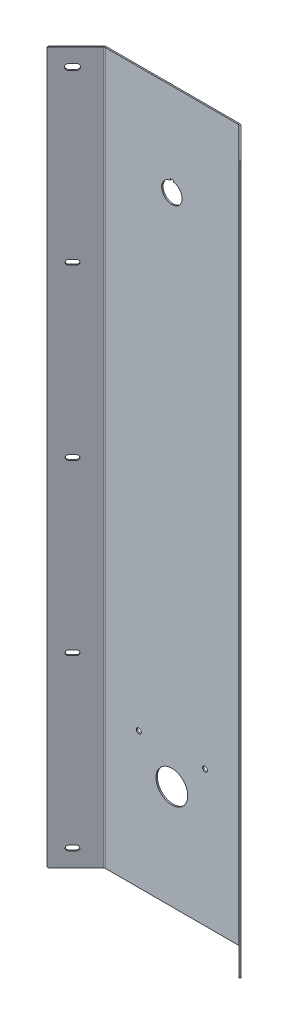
ISO-10303-21;
HEADER;
FILE_DESCRIPTION(('STEP AP214'),'2;1');
FILE_NAME('part.step','',(''),(''),'','','');
FILE_SCHEMA(('AUTOMOTIVE_DESIGN { 1 0 10303 214 1 1 1 1 }'));
ENDSEC;
DATA;
#1=APPLICATION_CONTEXT('core data for automotive mechanical design processes');
#2=APPLICATION_PROTOCOL_DEFINITION('international standard','automotive_design',2000,#1);
#3=PRODUCT_CONTEXT('',#1,'mechanical');
#4=PRODUCT('Part','Part','',(#3));
#5=PRODUCT_RELATED_PRODUCT_CATEGORY('part','',(#4));
#6=PRODUCT_DEFINITION_FORMATION('','',#4);
#7=PRODUCT_DEFINITION_CONTEXT('part definition',#1,'design');
#8=PRODUCT_DEFINITION('design','',#6,#7);
#9=PRODUCT_DEFINITION_SHAPE('','',#8);
#10=(LENGTH_UNIT() NAMED_UNIT(*) SI_UNIT(.MILLI.,.METRE.));
#11=(NAMED_UNIT(*) PLANE_ANGLE_UNIT() SI_UNIT($,.RADIAN.));
#12=(NAMED_UNIT(*) SI_UNIT($,.STERADIAN.) SOLID_ANGLE_UNIT());
#13=UNCERTAINTY_MEASURE_WITH_UNIT(LENGTH_MEASURE(1.E-05),#10,'distance_accuracy_value','');
#14=(GEOMETRIC_REPRESENTATION_CONTEXT(3) GLOBAL_UNCERTAINTY_ASSIGNED_CONTEXT((#13)) GLOBAL_UNIT_ASSIGNED_CONTEXT((#10,
#11,#12)) REPRESENTATION_CONTEXT('',''));
#15=CARTESIAN_POINT('',(0.,0.,0.));
#16=DIRECTION('',(0.,0.,1.));
#17=DIRECTION('',(1.,0.,0.));
#18=AXIS2_PLACEMENT_3D('',#15,#16,#17);
#19=CARTESIAN_POINT('',(-74.2462120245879,-392.,-1.5));
#20=DIRECTION('',(0.,1.,0.));
#21=DIRECTION('',(1.,0.,0.));
#22=AXIS2_PLACEMENT_3D('',#19,#20,#21);
#23=PLANE('',#22);
#24=DIRECTION('',(0.,0.,-1.));
#25=VECTOR('',#24,1.);
#26=CARTESIAN_POINT('',(73.4177848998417,-392.,-1.50000000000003));
#27=LINE('',#26,#25);
#28=CARTESIAN_POINT('',(73.4177848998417,-392.,0.));
#29=VERTEX_POINT('',#28);
#30=CARTESIAN_POINT('',(73.4177848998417,-392.,-1.50000000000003));
#31=VERTEX_POINT('',#30);
#32=EDGE_CURVE('E834',#29,#31,#27,.T.);
#33=ORIENTED_EDGE('',*,*,#32,.F.);
#34=DIRECTION('',(-1.,0.,0.));
#35=VECTOR('',#34,1.);
#36=CARTESIAN_POINT('',(-74.2462120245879,-392.,0.));
#37=LINE('',#36,#35);
#38=CARTESIAN_POINT('',(-73.4177848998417,-392.,0.));
#39=VERTEX_POINT('',#38);
#40=EDGE_CURVE('E804',#39,#29,#37,.F.);
#41=ORIENTED_EDGE('',*,*,#40,.F.);
#42=DIRECTION('',(0.,0.,-1.));
#43=VECTOR('',#42,1.);
#44=CARTESIAN_POINT('',(-73.4177848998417,-392.,-1.5));
#45=LINE('',#44,#43);
#46=CARTESIAN_POINT('',(-73.4177848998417,-392.,-1.5));
#47=VERTEX_POINT('',#46);
#48=EDGE_CURVE('E832',#39,#47,#45,.T.);
#49=ORIENTED_EDGE('',*,*,#48,.T.);
#50=DIRECTION('',(1.,0.,0.));
#51=VECTOR('',#50,1.);
#52=CARTESIAN_POINT('',(-74.2462120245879,-392.,-1.5));
#53=LINE('',#52,#51);
#54=EDGE_CURVE('E736',#47,#31,#53,.T.);
#55=ORIENTED_EDGE('',*,*,#54,.T.);
#56=EDGE_LOOP('',(#33,#41,#49,#55));
#57=FACE_BOUND('',#56,.T.);
#58=ADVANCED_FACE('F36',(#57),#23,.F.);
#59=CARTESIAN_POINT('',(-73.4177848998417,-392.,2.));
#60=DIRECTION('',(0.,1.,0.));
#61=DIRECTION('',(0.,0.,1.));
#62=AXIS2_PLACEMENT_3D('',#59,#60,#61);
#63=PLANE('',#62);
#64=ORIENTED_EDGE('',*,*,#48,.F.);
#65=CARTESIAN_POINT('',(-73.4177848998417,-392.,2.));
#66=DIRECTION('',(0.,-1.,0.));
#67=DIRECTION('',(0.,0.,-1.));
#68=AXIS2_PLACEMENT_3D('',#65,#66,#67);
#69=CIRCLE('',#68,2.);
#70=CARTESIAN_POINT('',(-74.8319984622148,-392.,0.585786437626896));
#71=VERTEX_POINT('',#70);
#72=EDGE_CURVE('E727',#39,#71,#69,.F.);
#73=ORIENTED_EDGE('',*,*,#72,.T.);
#74=DIRECTION('',(-0.707106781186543,0.,-0.707106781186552));
#75=VECTOR('',#74,1.);
#76=CARTESIAN_POINT('',(-75.8926586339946,-392.,-0.474873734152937));
#77=LINE('',#76,#75);
#78=CARTESIAN_POINT('',(-75.8926586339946,-392.,-0.474873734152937));
#79=VERTEX_POINT('',#78);
#80=EDGE_CURVE('E829',#71,#79,#77,.T.);
#81=ORIENTED_EDGE('',*,*,#80,.T.);
#82=CARTESIAN_POINT('',(-73.4177848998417,-392.,2.));
#83=DIRECTION('',(0.,-1.,0.));
#84=DIRECTION('',(0.,0.,-1.));
#85=AXIS2_PLACEMENT_3D('',#82,#83,#84);
#86=CIRCLE('',#85,3.5);
#87=EDGE_CURVE('E770',#47,#79,#86,.F.);
#88=ORIENTED_EDGE('',*,*,#87,.F.);
#89=EDGE_LOOP('',(#64,#73,#81,#88));
#90=FACE_BOUND('',#89,.T.);
#91=ADVANCED_FACE('F1007',(#90),#63,.F.);
#92=CARTESIAN_POINT('',(-75.3068721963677,-392.,-1.06066017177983));
#93=DIRECTION('',(0.,1.,0.));
#94=DIRECTION('',(0.707106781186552,0.,-0.707106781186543));
#95=AXIS2_PLACEMENT_3D('',#92,#93,#94);
#96=PLANE('',#95);
#97=DIRECTION('',(-0.707106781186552,0.,0.707106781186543));
#98=VECTOR('',#97,1.);
#99=CARTESIAN_POINT('',(-74.2462120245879,-392.,0.));
#100=LINE('',#99,#98);
#101=CARTESIAN_POINT('',(-104.65180361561,-392.,30.4055915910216));
#102=VERTEX_POINT('',#101);
#103=EDGE_CURVE('E800',#102,#71,#100,.F.);
#104=ORIENTED_EDGE('',*,*,#103,.F.);
#105=DIRECTION('',(0.707106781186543,0.,0.707106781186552));
#106=VECTOR('',#105,1.);
#107=CARTESIAN_POINT('',(-105.71246378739,-392.,29.3449314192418));
#108=LINE('',#107,#106);
#109=CARTESIAN_POINT('',(-105.71246378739,-392.,29.3449314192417));
#110=VERTEX_POINT('',#109);
#111=EDGE_CURVE('E900',#102,#110,#108,.F.);
#112=ORIENTED_EDGE('',*,*,#111,.T.);
#113=DIRECTION('',(0.707106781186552,0.,-0.707106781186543));
#114=VECTOR('',#113,1.);
#115=CARTESIAN_POINT('',(-75.3068721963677,-392.,-1.06066017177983));
#116=LINE('',#115,#114);
#117=EDGE_CURVE('E728',#110,#79,#116,.T.);
#118=ORIENTED_EDGE('',*,*,#117,.T.);
#119=ORIENTED_EDGE('',*,*,#80,.F.);
#120=EDGE_LOOP('',(#104,#112,#118,#119));
#121=FACE_BOUND('',#120,.T.);
#122=ADVANCED_FACE('F1013',(#121),#96,.F.);
#123=CARTESIAN_POINT('',(-107.126677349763,392.,30.7591449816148));
#124=DIRECTION('',(0.707106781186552,0.,-0.707106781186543));
#125=DIRECTION('',(0.,-1.,0.));
#126=AXIS2_PLACEMENT_3D('',#123,#124,#125);
#127=PLANE('',#126);
#128=DIRECTION('',(0.,-1.,0.));
#129=VECTOR('',#128,1.);
#130=CARTESIAN_POINT('',(-107.126677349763,392.,30.7591449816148));
#131=LINE('',#130,#129);
#132=CARTESIAN_POINT('',(-107.126677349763,390.,30.7591449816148));
#133=VERTEX_POINT('',#132);
#134=CARTESIAN_POINT('',(-107.126677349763,-390.,30.7591449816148));
#135=VERTEX_POINT('',#134);
#136=EDGE_CURVE('E730',#133,#135,#131,.T.);
#137=ORIENTED_EDGE('',*,*,#136,.T.);
#138=DIRECTION('',(0.707106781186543,0.,0.707106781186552));
#139=VECTOR('',#138,1.);
#140=CARTESIAN_POINT('',(-107.126677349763,-390.,30.7591449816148));
#141=LINE('',#140,#139);
#142=CARTESIAN_POINT('',(-106.066017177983,-390.,31.8198051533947));
#143=VERTEX_POINT('',#142);
#144=EDGE_CURVE('E910',#135,#143,#141,.T.);
#145=ORIENTED_EDGE('',*,*,#144,.T.);
#146=DIRECTION('',(0.,1.,0.));
#147=VECTOR('',#146,1.);
#148=CARTESIAN_POINT('',(-106.066017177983,392.,31.8198051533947));
#149=LINE('',#148,#147);
#150=CARTESIAN_POINT('',(-106.066017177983,390.,31.8198051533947));
#151=VERTEX_POINT('',#150);
#152=EDGE_CURVE('E810',#151,#143,#149,.F.);
#153=ORIENTED_EDGE('',*,*,#152,.F.);
#154=DIRECTION('',(-0.707106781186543,0.,-0.707106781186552));
#155=VECTOR('',#154,1.);
#156=CARTESIAN_POINT('',(-107.126677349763,390.,30.7591449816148));
#157=LINE('',#156,#155);
#158=EDGE_CURVE('E907',#151,#133,#157,.T.);
#159=ORIENTED_EDGE('',*,*,#158,.T.);
#160=EDGE_LOOP('',(#137,#145,#153,#159));
#161=FACE_BOUND('',#160,.T.);
#162=ADVANCED_FACE('F1050',(#161),#127,.F.);
#163=CARTESIAN_POINT('',(-75.3068721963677,392.,-1.06066017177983));
#164=DIRECTION('',(0.,1.,0.));
#165=DIRECTION('',(0.707106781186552,0.,-0.707106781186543));
#166=AXIS2_PLACEMENT_3D('',#163,#164,#165);
#167=PLANE('',#166);
#168=DIRECTION('',(0.707106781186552,0.,-0.707106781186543));
#169=VECTOR('',#168,1.);
#170=CARTESIAN_POINT('',(-75.3068721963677,392.,-1.06066017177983));
#171=LINE('',#170,#169);
#172=CARTESIAN_POINT('',(-105.71246378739,392.,29.3449314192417));
#173=VERTEX_POINT('',#172);
#174=CARTESIAN_POINT('',(-75.8926586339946,392.,-0.474873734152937));
#175=VERTEX_POINT('',#174);
#176=EDGE_CURVE('E734',#173,#175,#171,.T.);
#177=ORIENTED_EDGE('',*,*,#176,.F.);
#178=DIRECTION('',(0.707106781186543,0.,0.707106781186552));
#179=VECTOR('',#178,1.);
#180=CARTESIAN_POINT('',(-105.71246378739,392.,29.3449314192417));
#181=LINE('',#180,#179);
#182=CARTESIAN_POINT('',(-104.65180361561,392.,30.4055915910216));
#183=VERTEX_POINT('',#182);
#184=EDGE_CURVE('E916',#173,#183,#181,.T.);
#185=ORIENTED_EDGE('',*,*,#184,.T.);
#186=DIRECTION('',(-0.707106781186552,0.,0.707106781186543));
#187=VECTOR('',#186,1.);
#188=CARTESIAN_POINT('',(-74.2462120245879,392.,0.));
#189=LINE('',#188,#187);
#190=CARTESIAN_POINT('',(-74.8319984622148,392.,0.585786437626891));
#191=VERTEX_POINT('',#190);
#192=EDGE_CURVE('E808',#183,#191,#189,.F.);
#193=ORIENTED_EDGE('',*,*,#192,.T.);
#194=DIRECTION('',(-0.707106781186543,0.,-0.707106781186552));
#195=VECTOR('',#194,1.);
#196=CARTESIAN_POINT('',(-75.8926586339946,392.,-0.474873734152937));
#197=LINE('',#196,#195);
#198=EDGE_CURVE('E826',#191,#175,#197,.T.);
#199=ORIENTED_EDGE('',*,*,#198,.T.);
#200=EDGE_LOOP('',(#177,#185,#193,#199));
#201=FACE_BOUND('',#200,.T.);
#202=ADVANCED_FACE('F1078',(#201),#167,.T.);
#203=CARTESIAN_POINT('',(-73.4177848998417,392.,2.));
#204=DIRECTION('',(0.,-1.,0.));
#205=DIRECTION('',(0.,0.,-1.));
#206=AXIS2_PLACEMENT_3D('',#203,#204,#205);
#207=PLANE('',#206);
#208=ORIENTED_EDGE('',*,*,#198,.F.);
#209=CARTESIAN_POINT('',(-73.4177848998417,392.,2.));
#210=DIRECTION('',(0.,-1.,0.));
#211=DIRECTION('',(0.,0.,-1.));
#212=AXIS2_PLACEMENT_3D('',#209,#210,#211);
#213=CIRCLE('',#212,2.);
#214=CARTESIAN_POINT('',(-73.4177848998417,392.,0.));
#215=VERTEX_POINT('',#214);
#216=EDGE_CURVE('E805',#191,#215,#213,.T.);
#217=ORIENTED_EDGE('',*,*,#216,.T.);
#218=DIRECTION('',(0.,0.,-1.));
#219=VECTOR('',#218,1.);
#220=CARTESIAN_POINT('',(-73.4177848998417,392.,-1.5));
#221=LINE('',#220,#219);
#222=CARTESIAN_POINT('',(-73.4177848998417,392.,-1.5));
#223=VERTEX_POINT('',#222);
#224=EDGE_CURVE('E824',#215,#223,#221,.T.);
#225=ORIENTED_EDGE('',*,*,#224,.T.);
#226=CARTESIAN_POINT('',(-73.4177848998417,392.,2.));
#227=DIRECTION('',(0.,1.,0.));
#228=DIRECTION('',(0.,0.,1.));
#229=AXIS2_PLACEMENT_3D('',#226,#227,#228);
#230=CIRCLE('',#229,3.5);
#231=EDGE_CURVE('E761',#175,#223,#230,.F.);
#232=ORIENTED_EDGE('',*,*,#231,.F.);
#233=EDGE_LOOP('',(#208,#217,#225,#232));
#234=FACE_BOUND('',#233,.T.);
#235=ADVANCED_FACE('F1073',(#234),#207,.F.);
#236=CARTESIAN_POINT('',(-74.2462120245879,392.,-1.5));
#237=DIRECTION('',(0.,1.,0.));
#238=DIRECTION('',(1.,0.,0.));
#239=AXIS2_PLACEMENT_3D('',#236,#237,#238);
#240=PLANE('',#239);
#241=ORIENTED_EDGE('',*,*,#224,.F.);
#242=DIRECTION('',(-1.,0.,0.));
#243=VECTOR('',#242,1.);
#244=CARTESIAN_POINT('',(-74.2462120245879,392.,0.));
#245=LINE('',#244,#243);
#246=CARTESIAN_POINT('',(73.4177848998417,392.,0.));
#247=VERTEX_POINT('',#246);
#248=EDGE_CURVE('E792',#215,#247,#245,.F.);
#249=ORIENTED_EDGE('',*,*,#248,.T.);
#250=DIRECTION('',(0.,0.,-1.));
#251=VECTOR('',#250,1.);
#252=CARTESIAN_POINT('',(73.4177848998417,392.,-1.50000000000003));
#253=LINE('',#252,#251);
#254=CARTESIAN_POINT('',(73.4177848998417,392.,-1.50000000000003));
#255=VERTEX_POINT('',#254);
#256=EDGE_CURVE('E822',#247,#255,#253,.T.);
#257=ORIENTED_EDGE('',*,*,#256,.T.);
#258=DIRECTION('',(1.,0.,0.));
#259=VECTOR('',#258,1.);
#260=CARTESIAN_POINT('',(-74.2462120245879,392.,-1.5));
#261=LINE('',#260,#259);
#262=EDGE_CURVE('E739',#223,#255,#261,.T.);
#263=ORIENTED_EDGE('',*,*,#262,.F.);
#264=EDGE_LOOP('',(#241,#249,#257,#263));
#265=FACE_BOUND('',#264,.T.);
#266=ADVANCED_FACE('F1095',(#265),#240,.T.);
#267=CARTESIAN_POINT('',(73.4177848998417,392.,1.99999999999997));
#268=DIRECTION('',(0.,-1.,0.));
#269=DIRECTION('',(0.,0.,-1.));
#270=AXIS2_PLACEMENT_3D('',#267,#268,#269);
#271=PLANE('',#270);
#272=ORIENTED_EDGE('',*,*,#256,.F.);
#273=CARTESIAN_POINT('',(73.4177848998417,392.,1.99999999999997));
#274=DIRECTION('',(0.,-1.,0.));
#275=DIRECTION('',(0.,0.,-1.));
#276=AXIS2_PLACEMENT_3D('',#273,#274,#275);
#277=CIRCLE('',#276,2.);
#278=CARTESIAN_POINT('',(74.8319984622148,392.,0.585786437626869));
#279=VERTEX_POINT('',#278);
#280=EDGE_CURVE('E797',#247,#279,#277,.T.);
#281=ORIENTED_EDGE('',*,*,#280,.T.);
#282=DIRECTION('',(0.707106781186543,0.,-0.707106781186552));
#283=VECTOR('',#282,1.);
#284=CARTESIAN_POINT('',(75.8926586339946,392.,-0.474873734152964));
#285=LINE('',#284,#283);
#286=CARTESIAN_POINT('',(75.8926586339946,392.,-0.474873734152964));
#287=VERTEX_POINT('',#286);
#288=EDGE_CURVE('E820',#279,#287,#285,.T.);
#289=ORIENTED_EDGE('',*,*,#288,.T.);
#290=CARTESIAN_POINT('',(73.4177848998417,392.,1.99999999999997));
#291=DIRECTION('',(0.,1.,0.));
#292=DIRECTION('',(0.,0.,1.));
#293=AXIS2_PLACEMENT_3D('',#290,#291,#292);
#294=CIRCLE('',#293,3.5);
#295=EDGE_CURVE('E731',#255,#287,#294,.F.);
#296=ORIENTED_EDGE('',*,*,#295,.F.);
#297=EDGE_LOOP('',(#272,#281,#289,#296));
#298=FACE_BOUND('',#297,.T.);
#299=ADVANCED_FACE('F1094',(#298),#271,.F.);
#300=CARTESIAN_POINT('',(75.3068721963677,392.,-1.06066017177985));
#301=DIRECTION('',(0.,1.,0.));
#302=DIRECTION('',(0.707106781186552,0.,0.707106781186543));
#303=AXIS2_PLACEMENT_3D('',#300,#301,#302);
#304=PLANE('',#303);
#305=DIRECTION('',(-0.707106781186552,0.,-0.707106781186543));
#306=VECTOR('',#305,1.);
#307=CARTESIAN_POINT('',(74.2462120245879,392.,0.));
#308=LINE('',#307,#306);
#309=CARTESIAN_POINT('',(104.65180361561,392.,30.4055915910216));
#310=VERTEX_POINT('',#309);
#311=EDGE_CURVE('E791',#279,#310,#308,.F.);
#312=ORIENTED_EDGE('',*,*,#311,.T.);
#313=DIRECTION('',(0.707106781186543,0.,-0.707106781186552));
#314=VECTOR('',#313,1.);
#315=CARTESIAN_POINT('',(105.71246378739,392.,29.3449314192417));
#316=LINE('',#315,#314);
#317=CARTESIAN_POINT('',(105.71246378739,392.,29.3449314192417));
#318=VERTEX_POINT('',#317);
#319=EDGE_CURVE('E918',#310,#318,#316,.T.);
#320=ORIENTED_EDGE('',*,*,#319,.T.);
#321=DIRECTION('',(0.707106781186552,0.,0.707106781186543));
#322=VECTOR('',#321,1.);
#323=CARTESIAN_POINT('',(75.3068721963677,392.,-1.06066017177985));
#324=LINE('',#323,#322);
#325=EDGE_CURVE('E745',#287,#318,#324,.T.);
#326=ORIENTED_EDGE('',*,*,#325,.F.);
#327=ORIENTED_EDGE('',*,*,#288,.F.);
#328=EDGE_LOOP('',(#312,#320,#326,#327));
#329=FACE_BOUND('',#328,.T.);
#330=ADVANCED_FACE('F1102',(#329),#304,.T.);
#331=CARTESIAN_POINT('',(107.126677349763,392.,30.7591449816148));
#332=DIRECTION('',(0.707106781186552,0.,0.707106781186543));
#333=DIRECTION('',(0.,-1.,0.));
#334=AXIS2_PLACEMENT_3D('',#331,#332,#333);
#335=PLANE('',#334);
#336=DIRECTION('',(0.,1.,0.));
#337=VECTOR('',#336,1.);
#338=CARTESIAN_POINT('',(106.066017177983,392.,31.8198051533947));
#339=LINE('',#338,#337);
#340=CARTESIAN_POINT('',(106.066017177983,390.,31.8198051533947));
#341=VERTEX_POINT('',#340);
#342=CARTESIAN_POINT('',(106.066017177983,-390.,31.8198051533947));
#343=VERTEX_POINT('',#342);
#344=EDGE_CURVE('E783',#341,#343,#339,.F.);
#345=ORIENTED_EDGE('',*,*,#344,.T.);
#346=DIRECTION('',(-0.707106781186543,0.,0.707106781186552));
#347=VECTOR('',#346,1.);
#348=CARTESIAN_POINT('',(107.126677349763,-390.,30.7591449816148));
#349=LINE('',#348,#347);
#350=CARTESIAN_POINT('',(107.126677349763,-390.,30.7591449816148));
#351=VERTEX_POINT('',#350);
#352=EDGE_CURVE('E887',#343,#351,#349,.F.);
#353=ORIENTED_EDGE('',*,*,#352,.T.);
#354=DIRECTION('',(0.,-1.,0.));
#355=VECTOR('',#354,1.);
#356=CARTESIAN_POINT('',(107.126677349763,392.,30.7591449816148));
#357=LINE('',#356,#355);
#358=CARTESIAN_POINT('',(107.126677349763,390.,30.7591449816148));
#359=VERTEX_POINT('',#358);
#360=EDGE_CURVE('E748',#359,#351,#357,.T.);
#361=ORIENTED_EDGE('',*,*,#360,.F.);
#362=DIRECTION('',(0.707106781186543,0.,-0.707106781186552));
#363=VECTOR('',#362,1.);
#364=CARTESIAN_POINT('',(107.126677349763,390.,30.7591449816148));
#365=LINE('',#364,#363);
#366=EDGE_CURVE('E885',#359,#341,#365,.F.);
#367=ORIENTED_EDGE('',*,*,#366,.T.);
#368=EDGE_LOOP('',(#345,#353,#361,#367));
#369=FACE_BOUND('',#368,.T.);
#370=ADVANCED_FACE('F1927',(#369),#335,.T.);
#371=CARTESIAN_POINT('',(75.3068721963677,-392.,-1.06066017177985));
#372=DIRECTION('',(0.,1.,0.));
#373=DIRECTION('',(0.707106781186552,0.,0.707106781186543));
#374=AXIS2_PLACEMENT_3D('',#371,#372,#373);
#375=PLANE('',#374);
#376=DIRECTION('',(0.707106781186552,0.,0.707106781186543));
#377=VECTOR('',#376,1.);
#378=CARTESIAN_POINT('',(75.3068721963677,-392.,-1.06066017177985));
#379=LINE('',#378,#377);
#380=CARTESIAN_POINT('',(75.8926586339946,-392.,-0.474873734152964));
#381=VERTEX_POINT('',#380);
#382=CARTESIAN_POINT('',(105.71246378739,-392.,29.3449314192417));
#383=VERTEX_POINT('',#382);
#384=EDGE_CURVE('E742',#381,#383,#379,.T.);
#385=ORIENTED_EDGE('',*,*,#384,.T.);
#386=DIRECTION('',(0.707106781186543,0.,-0.707106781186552));
#387=VECTOR('',#386,1.);
#388=CARTESIAN_POINT('',(105.71246378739,-392.,29.3449314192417));
#389=LINE('',#388,#387);
#390=CARTESIAN_POINT('',(104.65180361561,-392.,30.4055915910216));
#391=VERTEX_POINT('',#390);
#392=EDGE_CURVE('E894',#383,#391,#389,.F.);
#393=ORIENTED_EDGE('',*,*,#392,.T.);
#394=DIRECTION('',(-0.707106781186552,0.,-0.707106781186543));
#395=VECTOR('',#394,1.);
#396=CARTESIAN_POINT('',(74.2462120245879,-392.,0.));
#397=LINE('',#396,#395);
#398=CARTESIAN_POINT('',(74.8319984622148,-392.,0.585786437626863));
#399=VERTEX_POINT('',#398);
#400=EDGE_CURVE('E788',#399,#391,#397,.F.);
#401=ORIENTED_EDGE('',*,*,#400,.F.);
#402=DIRECTION('',(0.707106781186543,0.,-0.707106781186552));
#403=VECTOR('',#402,1.);
#404=CARTESIAN_POINT('',(75.8926586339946,-392.,-0.474873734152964));
#405=LINE('',#404,#403);
#406=EDGE_CURVE('E769',#399,#381,#405,.T.);
#407=ORIENTED_EDGE('',*,*,#406,.T.);
#408=EDGE_LOOP('',(#385,#393,#401,#407));
#409=FACE_BOUND('',#408,.T.);
#410=ADVANCED_FACE('F1022',(#409),#375,.F.);
#411=CARTESIAN_POINT('',(73.4177848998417,-392.,1.99999999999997));
#412=DIRECTION('',(0.,1.,0.));
#413=DIRECTION('',(0.,0.,1.));
#414=AXIS2_PLACEMENT_3D('',#411,#412,#413);
#415=PLANE('',#414);
#416=CARTESIAN_POINT('',(73.4177848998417,-392.,1.99999999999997));
#417=DIRECTION('',(0.,-1.,0.));
#418=DIRECTION('',(0.,0.,-1.));
#419=AXIS2_PLACEMENT_3D('',#416,#417,#418);
#420=CIRCLE('',#419,2.);
#421=EDGE_CURVE('E801',#399,#29,#420,.F.);
#422=ORIENTED_EDGE('',*,*,#421,.T.);
#423=ORIENTED_EDGE('',*,*,#32,.T.);
#424=CARTESIAN_POINT('',(73.4177848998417,-392.,1.99999999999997));
#425=DIRECTION('',(0.,-1.,0.));
#426=DIRECTION('',(0.,0.,-1.));
#427=AXIS2_PLACEMENT_3D('',#424,#425,#426);
#428=CIRCLE('',#427,3.5);
#429=EDGE_CURVE('E758',#381,#31,#428,.F.);
#430=ORIENTED_EDGE('',*,*,#429,.F.);
#431=ORIENTED_EDGE('',*,*,#406,.F.);
#432=EDGE_LOOP('',(#422,#423,#430,#431));
#433=FACE_BOUND('',#432,.T.);
#434=ADVANCED_FACE('F1018',(#433),#415,.F.);
#435=CARTESIAN_POINT('',(75.3068721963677,392.,-1.06066017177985));
#436=DIRECTION('',(0.707106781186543,0.,-0.707106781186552));
#437=DIRECTION('',(-0.707106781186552,0.,-0.707106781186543));
#438=AXIS2_PLACEMENT_3D('',#435,#436,#437);
#439=PLANE('',#438);
#440=CARTESIAN_POINT('',(95.1058620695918,373.,18.7383297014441));
#441=DIRECTION('',(0.707106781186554,0.,-0.707106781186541));
#442=DIRECTION('',(-0.707106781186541,0.,-0.707106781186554));
#443=AXIS2_PLACEMENT_3D('',#440,#441,#442);
#444=CIRCLE('',#443,3.30000000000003);
#445=CARTESIAN_POINT('',(95.1058620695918,376.3,18.7383297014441));
#446=VERTEX_POINT('',#445);
#447=CARTESIAN_POINT('',(95.1058620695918,369.7,18.738329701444));
#448=VERTEX_POINT('',#447);
#449=EDGE_CURVE('E477',#446,#448,#444,.T.);
#450=ORIENTED_EDGE('',*,*,#449,.F.);
#451=DIRECTION('',(0.707106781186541,0.,0.707106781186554));
#452=VECTOR('',#451,1.);
#453=CARTESIAN_POINT('',(95.1058620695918,376.3,18.7383297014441));
#454=LINE('',#453,#452);
#455=CARTESIAN_POINT('',(90.8632213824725,376.3,14.4956890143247));
#456=VERTEX_POINT('',#455);
#457=EDGE_CURVE('E495',#456,#446,#454,.T.);
#458=ORIENTED_EDGE('',*,*,#457,.F.);
#459=CARTESIAN_POINT('',(90.8632213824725,373.,14.4956890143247));
#460=DIRECTION('',(0.707106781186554,0.,-0.707106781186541));
#461=DIRECTION('',(-0.707106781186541,0.,-0.707106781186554));
#462=AXIS2_PLACEMENT_3D('',#459,#460,#461);
#463=CIRCLE('',#462,3.30000000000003);
#464=CARTESIAN_POINT('',(90.8632213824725,369.7,14.4956890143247));
#465=VERTEX_POINT('',#464);
#466=EDGE_CURVE('E492',#465,#456,#463,.T.);
#467=ORIENTED_EDGE('',*,*,#466,.F.);
#468=DIRECTION('',(-0.707106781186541,0.,-0.707106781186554));
#469=VECTOR('',#468,1.);
#470=CARTESIAN_POINT('',(95.1058620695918,369.7,18.7383297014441));
#471=LINE('',#470,#469);
#472=EDGE_CURVE('E489',#448,#465,#471,.T.);
#473=ORIENTED_EDGE('',*,*,#472,.F.);
#474=EDGE_LOOP('',(#450,#458,#467,#473));
#475=FACE_BOUND('',#474,.T.);
#476=DIRECTION('',(0.707106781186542,0.,0.707106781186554));
#477=VECTOR('',#476,1.);
#478=CARTESIAN_POINT('',(95.1058620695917,-183.75,18.738329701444));
#479=LINE('',#478,#477);
#480=CARTESIAN_POINT('',(90.8632213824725,-183.75,14.4956890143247));
#481=VERTEX_POINT('',#480);
#482=CARTESIAN_POINT('',(95.1058620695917,-183.75,18.738329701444));
#483=VERTEX_POINT('',#482);
#484=EDGE_CURVE('E537',#481,#483,#479,.T.);
#485=ORIENTED_EDGE('',*,*,#484,.F.);
#486=CARTESIAN_POINT('',(90.8632213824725,-186.5,14.4956890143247));
#487=DIRECTION('',(0.707106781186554,0.,-0.707106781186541));
#488=DIRECTION('',(-0.707106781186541,0.,-0.707106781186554));
#489=AXIS2_PLACEMENT_3D('',#486,#487,#488);
#490=CIRCLE('',#489,2.74999999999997);
#491=CARTESIAN_POINT('',(90.8632213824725,-189.25,14.4956890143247));
#492=VERTEX_POINT('',#491);
#493=EDGE_CURVE('E534',#492,#481,#490,.T.);
#494=ORIENTED_EDGE('',*,*,#493,.F.);
#495=DIRECTION('',(-0.707106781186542,0.,-0.707106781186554));
#496=VECTOR('',#495,1.);
#497=CARTESIAN_POINT('',(95.1058620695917,-189.25,18.738329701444));
#498=LINE('',#497,#496);
#499=CARTESIAN_POINT('',(95.1058620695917,-189.25,18.738329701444));
#500=VERTEX_POINT('',#499);
#501=EDGE_CURVE('E531',#500,#492,#498,.T.);
#502=ORIENTED_EDGE('',*,*,#501,.F.);
#503=CARTESIAN_POINT('',(95.1058620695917,-186.5,18.738329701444));
#504=DIRECTION('',(0.707106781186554,0.,-0.707106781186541));
#505=DIRECTION('',(-0.707106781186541,0.,-0.707106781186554));
#506=AXIS2_PLACEMENT_3D('',#503,#504,#505);
#507=CIRCLE('',#506,2.74999999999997);
#508=EDGE_CURVE('E528',#483,#500,#507,.T.);
#509=ORIENTED_EDGE('',*,*,#508,.F.);
#510=EDGE_LOOP('',(#485,#494,#502,#509));
#511=FACE_BOUND('',#510,.T.);
#512=DIRECTION('',(0.707106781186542,0.,0.707106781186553));
#513=VECTOR('',#512,1.);
#514=CARTESIAN_POINT('',(95.1058620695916,2.74999999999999,18.7383297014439));
#515=LINE('',#514,#513);
#516=CARTESIAN_POINT('',(90.8632213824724,2.75,14.4956890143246));
#517=VERTEX_POINT('',#516);
#518=CARTESIAN_POINT('',(95.1058620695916,2.74999999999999,18.7383297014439));
#519=VERTEX_POINT('',#518);
#520=EDGE_CURVE('E560',#517,#519,#515,.T.);
#521=ORIENTED_EDGE('',*,*,#520,.F.);
#522=CARTESIAN_POINT('',(90.8632213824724,0.,14.4956890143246));
#523=DIRECTION('',(0.707106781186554,0.,-0.707106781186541));
#524=DIRECTION('',(-0.707106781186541,0.,-0.707106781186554));
#525=AXIS2_PLACEMENT_3D('',#522,#523,#524);
#526=CIRCLE('',#525,2.74999999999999);
#527=CARTESIAN_POINT('',(90.8632213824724,-2.74999999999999,14.4956890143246));
#528=VERTEX_POINT('',#527);
#529=EDGE_CURVE('E557',#528,#517,#526,.T.);
#530=ORIENTED_EDGE('',*,*,#529,.F.);
#531=DIRECTION('',(-0.707106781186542,0.,-0.707106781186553));
#532=VECTOR('',#531,1.);
#533=CARTESIAN_POINT('',(95.1058620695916,-2.74999999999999,18.7383297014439));
#534=LINE('',#533,#532);
#535=CARTESIAN_POINT('',(95.1058620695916,-2.74999999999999,18.7383297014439));
#536=VERTEX_POINT('',#535);
#537=EDGE_CURVE('E554',#536,#528,#534,.T.);
#538=ORIENTED_EDGE('',*,*,#537,.F.);
#539=CARTESIAN_POINT('',(95.1058620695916,0.,18.7383297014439));
#540=DIRECTION('',(0.707106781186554,0.,-0.707106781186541));
#541=DIRECTION('',(-0.707106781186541,0.,-0.707106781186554));
#542=AXIS2_PLACEMENT_3D('',#539,#540,#541);
#543=CIRCLE('',#542,2.74999999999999);
#544=EDGE_CURVE('E551',#519,#536,#543,.T.);
#545=ORIENTED_EDGE('',*,*,#544,.F.);
#546=EDGE_LOOP('',(#521,#530,#538,#545));
#547=FACE_BOUND('',#546,.T.);
#548=DIRECTION('',(0.707106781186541,0.,0.707106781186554));
#549=VECTOR('',#548,1.);
#550=CARTESIAN_POINT('',(95.1058620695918,189.25,18.738329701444));
#551=LINE('',#550,#549);
#552=CARTESIAN_POINT('',(90.8632213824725,189.25,14.4956890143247));
#553=VERTEX_POINT('',#552);
#554=CARTESIAN_POINT('',(95.1058620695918,189.25,18.738329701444));
#555=VERTEX_POINT('',#554);
#556=EDGE_CURVE('E579',#553,#555,#551,.T.);
#557=ORIENTED_EDGE('',*,*,#556,.F.);
#558=CARTESIAN_POINT('',(90.8632213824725,186.5,14.4956890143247));
#559=DIRECTION('',(0.707106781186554,0.,-0.707106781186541));
#560=DIRECTION('',(-0.707106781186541,0.,-0.707106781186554));
#561=AXIS2_PLACEMENT_3D('',#558,#559,#560);
#562=CIRCLE('',#561,2.74999999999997);
#563=CARTESIAN_POINT('',(90.8632213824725,183.75,14.4956890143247));
#564=VERTEX_POINT('',#563);
#565=EDGE_CURVE('E576',#564,#553,#562,.T.);
#566=ORIENTED_EDGE('',*,*,#565,.F.);
#567=DIRECTION('',(-0.707106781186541,0.,-0.707106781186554));
#568=VECTOR('',#567,1.);
#569=CARTESIAN_POINT('',(95.1058620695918,183.75,18.738329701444));
#570=LINE('',#569,#568);
#571=CARTESIAN_POINT('',(95.1058620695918,183.75,18.738329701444));
#572=VERTEX_POINT('',#571);
#573=EDGE_CURVE('E574',#572,#564,#570,.T.);
#574=ORIENTED_EDGE('',*,*,#573,.F.);
#575=CARTESIAN_POINT('',(95.1058620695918,186.5,18.738329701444));
#576=DIRECTION('',(0.707106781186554,0.,-0.707106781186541));
#577=DIRECTION('',(-0.707106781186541,0.,-0.707106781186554));
#578=AXIS2_PLACEMENT_3D('',#575,#576,#577);
#579=CIRCLE('',#578,2.74999999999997);
#580=EDGE_CURVE('E521',#555,#572,#579,.T.);
#581=ORIENTED_EDGE('',*,*,#580,.F.);
#582=EDGE_LOOP('',(#557,#566,#574,#581));
#583=FACE_BOUND('',#582,.T.);
#584=DIRECTION('',(0.707106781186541,0.,0.707106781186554));
#585=VECTOR('',#584,1.);
#586=CARTESIAN_POINT('',(95.1058620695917,-370.25,18.738329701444));
#587=LINE('',#586,#585);
#588=CARTESIAN_POINT('',(90.8632213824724,-370.25,14.4956890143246));
#589=VERTEX_POINT('',#588);
#590=CARTESIAN_POINT('',(95.1058620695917,-370.25,18.738329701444));
#591=VERTEX_POINT('',#590);
#592=EDGE_CURVE('E610',#589,#591,#587,.T.);
#593=ORIENTED_EDGE('',*,*,#592,.F.);
#594=CARTESIAN_POINT('',(90.8632213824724,-373.,14.4956890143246));
#595=DIRECTION('',(0.707106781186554,0.,-0.707106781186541));
#596=DIRECTION('',(-0.707106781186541,0.,-0.707106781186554));
#597=AXIS2_PLACEMENT_3D('',#594,#595,#596);
#598=CIRCLE('',#597,2.74999999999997);
#599=CARTESIAN_POINT('',(90.8632213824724,-375.75,14.4956890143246));
#600=VERTEX_POINT('',#599);
#601=EDGE_CURVE('E607',#600,#589,#598,.T.);
#602=ORIENTED_EDGE('',*,*,#601,.F.);
#603=DIRECTION('',(-0.707106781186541,0.,-0.707106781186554));
#604=VECTOR('',#603,1.);
#605=CARTESIAN_POINT('',(95.1058620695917,-375.75,18.738329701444));
#606=LINE('',#605,#604);
#607=CARTESIAN_POINT('',(95.1058620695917,-375.75,18.738329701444));
#608=VERTEX_POINT('',#607);
#609=EDGE_CURVE('E605',#608,#600,#606,.T.);
#610=ORIENTED_EDGE('',*,*,#609,.F.);
#611=CARTESIAN_POINT('',(95.1058620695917,-373.,18.738329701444));
#612=DIRECTION('',(0.707106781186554,0.,-0.707106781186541));
#613=DIRECTION('',(-0.707106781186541,0.,-0.707106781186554));
#614=AXIS2_PLACEMENT_3D('',#611,#612,#613);
#615=CIRCLE('',#614,2.74999999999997);
#616=EDGE_CURVE('E602',#591,#608,#615,.T.);
#617=ORIENTED_EDGE('',*,*,#616,.F.);
#618=EDGE_LOOP('',(#593,#602,#610,#617));
#619=FACE_BOUND('',#618,.T.);
#620=ORIENTED_EDGE('',*,*,#360,.T.);
#621=CARTESIAN_POINT('',(105.71246378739,-390.,29.3449314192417));
#622=DIRECTION('',(0.707106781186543,0.,-0.707106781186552));
#623=DIRECTION('',(-0.707106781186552,0.,-0.707106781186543));
#624=AXIS2_PLACEMENT_3D('',#621,#622,#623);
#625=CIRCLE('',#624,2.);
#626=EDGE_CURVE('E892',#351,#383,#625,.T.);
#627=ORIENTED_EDGE('',*,*,#626,.T.);
#628=ORIENTED_EDGE('',*,*,#384,.F.);
#629=DIRECTION('',(0.,-1.,0.));
#630=VECTOR('',#629,1.);
#631=CARTESIAN_POINT('',(75.8926586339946,392.,-0.474873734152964));
#632=LINE('',#631,#630);
#633=EDGE_CURVE('E754',#381,#287,#632,.F.);
#634=ORIENTED_EDGE('',*,*,#633,.T.);
#635=ORIENTED_EDGE('',*,*,#325,.T.);
#636=CARTESIAN_POINT('',(105.71246378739,390.,29.3449314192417));
#637=DIRECTION('',(0.707106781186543,0.,-0.707106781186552));
#638=DIRECTION('',(-0.707106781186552,0.,-0.707106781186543));
#639=AXIS2_PLACEMENT_3D('',#636,#637,#638);
#640=CIRCLE('',#639,2.);
#641=EDGE_CURVE('E890',#318,#359,#640,.T.);
#642=ORIENTED_EDGE('',*,*,#641,.T.);
#643=EDGE_LOOP('',(#620,#627,#628,#634,#635,#642));
#644=FACE_BOUND('',#643,.T.);
#645=ADVANCED_FACE('F1021',(#475,#511,#547,#583,#619,#644),#439,.T.);
#646=CARTESIAN_POINT('',(-74.2462120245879,392.,-1.5));
#647=DIRECTION('',(0.,0.,-1.));
#648=DIRECTION('',(-1.,0.,0.));
#649=AXIS2_PLACEMENT_3D('',#646,#647,#648);
#650=PLANE('',#649);
#651=CARTESIAN_POINT('',(0.,-277.2,-1.50000000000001));
#652=DIRECTION('',(0.,0.,-1.));
#653=DIRECTION('',(-1.,0.,0.));
#654=AXIS2_PLACEMENT_3D('',#651,#652,#653);
#655=CIRCLE('',#654,17.5);
#656=CARTESIAN_POINT('',(-17.5,-277.2,-1.50000000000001));
#657=VERTEX_POINT('',#656);
#658=EDGE_CURVE('E987',#657,#657,#655,.T.);
#659=ORIENTED_EDGE('',*,*,#658,.F.);
#660=EDGE_LOOP('',(#659));
#661=FACE_BOUND('',#660,.T.);
#662=CARTESIAN_POINT('',(36.5,-242.2,-1.50000000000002));
#663=DIRECTION('',(0.,0.,-1.));
#664=DIRECTION('',(-1.,0.,0.));
#665=AXIS2_PLACEMENT_3D('',#662,#663,#664);
#666=CIRCLE('',#665,2.74999999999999);
#667=CARTESIAN_POINT('',(33.75,-242.2,-1.50000000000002));
#668=VERTEX_POINT('',#667);
#669=EDGE_CURVE('E984',#668,#668,#666,.T.);
#670=ORIENTED_EDGE('',*,*,#669,.F.);
#671=EDGE_LOOP('',(#670));
#672=FACE_BOUND('',#671,.T.);
#673=CARTESIAN_POINT('',(-36.5,-242.2,-1.50000000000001));
#674=DIRECTION('',(0.,0.,-1.));
#675=DIRECTION('',(-1.,0.,0.));
#676=AXIS2_PLACEMENT_3D('',#673,#674,#675);
#677=CIRCLE('',#676,2.74999999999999);
#678=CARTESIAN_POINT('',(-39.25,-242.2,-1.50000000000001));
#679=VERTEX_POINT('',#678);
#680=EDGE_CURVE('E976',#679,#679,#677,.T.);
#681=ORIENTED_EDGE('',*,*,#680,.F.);
#682=EDGE_LOOP('',(#681));
#683=FACE_BOUND('',#682,.T.);
#684=CARTESIAN_POINT('',(2.15,301.551623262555,-1.50000000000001));
#685=DIRECTION('',(0.,0.,1.));
#686=DIRECTION('',(1.,0.,0.));
#687=AXIS2_PLACEMENT_3D('',#684,#685,#686);
#688=CIRCLE('',#687,0.500000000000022);
#689=CARTESIAN_POINT('',(1.65,301.551623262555,-1.50000000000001));
#690=VERTEX_POINT('',#689);
#691=CARTESIAN_POINT('',(2.05851063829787,301.06006482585,-1.50000000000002));
#692=VERTEX_POINT('',#691);
#693=EDGE_CURVE('E52',#690,#692,#688,.T.);
#694=ORIENTED_EDGE('',*,*,#693,.F.);
#695=DIRECTION('',(0.,-1.,0.));
#696=VECTOR('',#695,1.);
#697=CARTESIAN_POINT('',(1.65,302.35,-1.50000000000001));
#698=LINE('',#697,#696);
#699=CARTESIAN_POINT('',(1.65,302.35,-1.50000000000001));
#700=VERTEX_POINT('',#699);
#701=EDGE_CURVE('E472',#700,#690,#698,.T.);
#702=ORIENTED_EDGE('',*,*,#701,.F.);
#703=CARTESIAN_POINT('',(1.15,302.35,-1.50000000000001));
#704=DIRECTION('',(0.,0.,-1.));
#705=DIRECTION('',(1.,0.,0.));
#706=AXIS2_PLACEMENT_3D('',#703,#704,#705);
#707=CIRCLE('',#706,0.499999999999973);
#708=CARTESIAN_POINT('',(1.15,302.85,-1.50000000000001));
#709=VERTEX_POINT('',#708);
#710=EDGE_CURVE('E469',#709,#700,#707,.T.);
#711=ORIENTED_EDGE('',*,*,#710,.F.);
#712=DIRECTION('',(1.,0.,0.));
#713=VECTOR('',#712,1.);
#714=CARTESIAN_POINT('',(-1.15,302.85,-1.50000000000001));
#715=LINE('',#714,#713);
#716=CARTESIAN_POINT('',(-1.15,302.85,-1.50000000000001));
#717=VERTEX_POINT('',#716);
#718=EDGE_CURVE('E466',#717,#709,#715,.T.);
#719=ORIENTED_EDGE('',*,*,#718,.F.);
#720=CARTESIAN_POINT('',(-1.15,302.35,-1.50000000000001));
#721=DIRECTION('',(0.,0.,-1.));
#722=DIRECTION('',(1.,0.,0.));
#723=AXIS2_PLACEMENT_3D('',#720,#721,#722);
#724=CIRCLE('',#723,0.499999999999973);
#725=CARTESIAN_POINT('',(-1.64999999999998,302.35,-1.50000000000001));
#726=VERTEX_POINT('',#725);
#727=EDGE_CURVE('E460',#726,#717,#724,.T.);
#728=ORIENTED_EDGE('',*,*,#727,.F.);
#729=DIRECTION('',(0.,1.,0.));
#730=VECTOR('',#729,1.);
#731=CARTESIAN_POINT('',(-1.65,302.35,-1.50000000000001));
#732=LINE('',#731,#730);
#733=CARTESIAN_POINT('',(-1.65,301.551623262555,-1.50000000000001));
#734=VERTEX_POINT('',#733);
#735=EDGE_CURVE('E458',#734,#726,#732,.T.);
#736=ORIENTED_EDGE('',*,*,#735,.F.);
#737=CARTESIAN_POINT('',(-2.15,301.551623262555,-1.50000000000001));
#738=DIRECTION('',(0.,0.,1.));
#739=DIRECTION('',(-1.,0.,0.));
#740=AXIS2_PLACEMENT_3D('',#737,#738,#739);
#741=CIRCLE('',#740,0.500000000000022);
#742=CARTESIAN_POINT('',(-2.05851063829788,301.06006482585,-1.50000000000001));
#743=VERTEX_POINT('',#742);
#744=EDGE_CURVE('E441',#743,#734,#741,.T.);
#745=ORIENTED_EDGE('',*,*,#744,.F.);
#746=CARTESIAN_POINT('',(0.,290.,-1.50000000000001));
#747=DIRECTION('',(0.,0.,-1.));
#748=DIRECTION('',(-1.,0.,0.));
#749=AXIS2_PLACEMENT_3D('',#746,#747,#748);
#750=CIRCLE('',#749,11.25);
#751=EDGE_CURVE('E450',#692,#743,#750,.T.);
#752=ORIENTED_EDGE('',*,*,#751,.F.);
#753=EDGE_LOOP('',(#694,#702,#711,#719,#728,#736,#745,#752));
#754=FACE_BOUND('',#753,.T.);
#755=ORIENTED_EDGE('',*,*,#54,.F.);
#756=DIRECTION('',(0.,-1.,0.));
#757=VECTOR('',#756,1.);
#758=CARTESIAN_POINT('',(-73.4177848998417,392.,-1.5));
#759=LINE('',#758,#757);
#760=EDGE_CURVE('E766',#47,#223,#759,.F.);
#761=ORIENTED_EDGE('',*,*,#760,.T.);
#762=ORIENTED_EDGE('',*,*,#262,.T.);
#763=DIRECTION('',(0.,-1.,0.));
#764=VECTOR('',#763,1.);
#765=CARTESIAN_POINT('',(73.4177848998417,392.,-1.50000000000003));
#766=LINE('',#765,#764);
#767=EDGE_CURVE('E751',#255,#31,#766,.T.);
#768=ORIENTED_EDGE('',*,*,#767,.T.);
#769=EDGE_LOOP('',(#755,#761,#762,#768));
#770=FACE_BOUND('',#769,.T.);
#771=ADVANCED_FACE('F454',(#661,#672,#683,#754,#770),#650,.T.);
#772=CARTESIAN_POINT('',(-75.3068721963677,392.,-1.06066017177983));
#773=DIRECTION('',(-0.707106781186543,0.,-0.707106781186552));
#774=DIRECTION('',(-0.707106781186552,0.,0.707106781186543));
#775=AXIS2_PLACEMENT_3D('',#772,#773,#774);
#776=PLANE('',#775);
#777=CARTESIAN_POINT('',(-90.863221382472,373.,14.4956890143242));
#778=DIRECTION('',(-0.707106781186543,0.,-0.707106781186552));
#779=DIRECTION('',(-0.707106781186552,0.,0.707106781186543));
#780=AXIS2_PLACEMENT_3D('',#777,#778,#779);
#781=CIRCLE('',#780,3.30000000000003);
#782=CARTESIAN_POINT('',(-90.863221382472,376.3,14.4956890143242));
#783=VERTEX_POINT('',#782);
#784=CARTESIAN_POINT('',(-90.863221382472,369.7,14.4956890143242));
#785=VERTEX_POINT('',#784);
#786=EDGE_CURVE('E501',#783,#785,#781,.T.);
#787=ORIENTED_EDGE('',*,*,#786,.F.);
#788=DIRECTION('',(0.707106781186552,0.,-0.707106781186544));
#789=VECTOR('',#788,1.);
#790=CARTESIAN_POINT('',(-90.863221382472,376.3,14.4956890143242));
#791=LINE('',#790,#789);
#792=CARTESIAN_POINT('',(-95.1058620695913,376.3,18.7383297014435));
#793=VERTEX_POINT('',#792);
#794=EDGE_CURVE('E515',#793,#783,#791,.T.);
#795=ORIENTED_EDGE('',*,*,#794,.F.);
#796=CARTESIAN_POINT('',(-95.1058620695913,373.,18.7383297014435));
#797=DIRECTION('',(-0.707106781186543,0.,-0.707106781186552));
#798=DIRECTION('',(-0.707106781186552,0.,0.707106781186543));
#799=AXIS2_PLACEMENT_3D('',#796,#797,#798);
#800=CIRCLE('',#799,3.30000000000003);
#801=CARTESIAN_POINT('',(-95.1058620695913,369.7,18.7383297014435));
#802=VERTEX_POINT('',#801);
#803=EDGE_CURVE('E512',#802,#793,#800,.T.);
#804=ORIENTED_EDGE('',*,*,#803,.F.);
#805=DIRECTION('',(-0.707106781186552,0.,0.707106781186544));
#806=VECTOR('',#805,1.);
#807=CARTESIAN_POINT('',(-90.863221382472,369.7,14.4956890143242));
#808=LINE('',#807,#806);
#809=EDGE_CURVE('E509',#785,#802,#808,.T.);
#810=ORIENTED_EDGE('',*,*,#809,.F.);
#811=EDGE_LOOP('',(#787,#795,#804,#810));
#812=FACE_BOUND('',#811,.T.);
#813=DIRECTION('',(0.707106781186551,0.,-0.707106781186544));
#814=VECTOR('',#813,1.);
#815=CARTESIAN_POINT('',(-90.863221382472,-183.75,14.4956890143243));
#816=LINE('',#815,#814);
#817=CARTESIAN_POINT('',(-95.1058620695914,-183.75,18.7383297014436));
#818=VERTEX_POINT('',#817);
#819=CARTESIAN_POINT('',(-90.863221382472,-183.75,14.4956890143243));
#820=VERTEX_POINT('',#819);
#821=EDGE_CURVE('E637',#818,#820,#816,.T.);
#822=ORIENTED_EDGE('',*,*,#821,.F.);
#823=CARTESIAN_POINT('',(-95.1058620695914,-186.5,18.7383297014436));
#824=DIRECTION('',(-0.707106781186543,0.,-0.707106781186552));
#825=DIRECTION('',(-0.707106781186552,0.,0.707106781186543));
#826=AXIS2_PLACEMENT_3D('',#823,#824,#825);
#827=CIRCLE('',#826,2.74999999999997);
#828=CARTESIAN_POINT('',(-95.1058620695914,-189.25,18.7383297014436));
#829=VERTEX_POINT('',#828);
#830=EDGE_CURVE('E634',#829,#818,#827,.T.);
#831=ORIENTED_EDGE('',*,*,#830,.F.);
#832=DIRECTION('',(-0.707106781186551,0.,0.707106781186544));
#833=VECTOR('',#832,1.);
#834=CARTESIAN_POINT('',(-90.863221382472,-189.25,14.4956890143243));
#835=LINE('',#834,#833);
#836=CARTESIAN_POINT('',(-90.863221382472,-189.25,14.4956890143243));
#837=VERTEX_POINT('',#836);
#838=EDGE_CURVE('E631',#837,#829,#835,.T.);
#839=ORIENTED_EDGE('',*,*,#838,.F.);
#840=CARTESIAN_POINT('',(-90.863221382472,-186.5,14.4956890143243));
#841=DIRECTION('',(-0.707106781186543,0.,-0.707106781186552));
#842=DIRECTION('',(-0.707106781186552,0.,0.707106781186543));
#843=AXIS2_PLACEMENT_3D('',#840,#841,#842);
#844=CIRCLE('',#843,2.74999999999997);
#845=EDGE_CURVE('E628',#820,#837,#844,.T.);
#846=ORIENTED_EDGE('',*,*,#845,.F.);
#847=EDGE_LOOP('',(#822,#831,#839,#846));
#848=FACE_BOUND('',#847,.T.);
#849=DIRECTION('',(0.70710678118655,0.,-0.707106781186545));
#850=VECTOR('',#849,1.);
#851=CARTESIAN_POINT('',(-90.8632213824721,2.74999999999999,14.4956890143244));
#852=LINE('',#851,#850);
#853=CARTESIAN_POINT('',(-95.1058620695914,2.75,18.7383297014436));
#854=VERTEX_POINT('',#853);
#855=CARTESIAN_POINT('',(-90.8632213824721,2.74999999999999,14.4956890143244));
#856=VERTEX_POINT('',#855);
#857=EDGE_CURVE('E660',#854,#856,#852,.T.);
#858=ORIENTED_EDGE('',*,*,#857,.F.);
#859=CARTESIAN_POINT('',(-95.1058620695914,0.,18.7383297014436));
#860=DIRECTION('',(-0.707106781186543,0.,-0.707106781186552));
#861=DIRECTION('',(-0.707106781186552,0.,0.707106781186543));
#862=AXIS2_PLACEMENT_3D('',#859,#860,#861);
#863=CIRCLE('',#862,2.74999999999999);
#864=CARTESIAN_POINT('',(-95.1058620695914,-2.74999999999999,18.7383297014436));
#865=VERTEX_POINT('',#864);
#866=EDGE_CURVE('E657',#865,#854,#863,.T.);
#867=ORIENTED_EDGE('',*,*,#866,.F.);
#868=DIRECTION('',(-0.70710678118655,0.,0.707106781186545));
#869=VECTOR('',#868,1.);
#870=CARTESIAN_POINT('',(-90.8632213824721,-2.74999999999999,14.4956890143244));
#871=LINE('',#870,#869);
#872=CARTESIAN_POINT('',(-90.8632213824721,-2.74999999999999,14.4956890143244));
#873=VERTEX_POINT('',#872);
#874=EDGE_CURVE('E654',#873,#865,#871,.T.);
#875=ORIENTED_EDGE('',*,*,#874,.F.);
#876=CARTESIAN_POINT('',(-90.8632213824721,0.,14.4956890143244));
#877=DIRECTION('',(-0.707106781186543,0.,-0.707106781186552));
#878=DIRECTION('',(-0.707106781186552,0.,0.707106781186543));
#879=AXIS2_PLACEMENT_3D('',#876,#877,#878);
#880=CIRCLE('',#879,2.74999999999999);
#881=EDGE_CURVE('E651',#856,#873,#880,.T.);
#882=ORIENTED_EDGE('',*,*,#881,.F.);
#883=EDGE_LOOP('',(#858,#867,#875,#882));
#884=FACE_BOUND('',#883,.T.);
#885=DIRECTION('',(0.707106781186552,0.,-0.707106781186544));
#886=VECTOR('',#885,1.);
#887=CARTESIAN_POINT('',(-90.863221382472,189.25,14.4956890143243));
#888=LINE('',#887,#886);
#889=CARTESIAN_POINT('',(-95.1058620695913,189.25,18.7383297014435));
#890=VERTEX_POINT('',#889);
#891=CARTESIAN_POINT('',(-90.863221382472,189.25,14.4956890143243));
#892=VERTEX_POINT('',#891);
#893=EDGE_CURVE('E679',#890,#892,#888,.T.);
#894=ORIENTED_EDGE('',*,*,#893,.F.);
#895=CARTESIAN_POINT('',(-95.1058620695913,186.5,18.7383297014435));
#896=DIRECTION('',(-0.707106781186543,0.,-0.707106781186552));
#897=DIRECTION('',(-0.707106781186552,0.,0.707106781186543));
#898=AXIS2_PLACEMENT_3D('',#895,#896,#897);
#899=CIRCLE('',#898,2.74999999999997);
#900=CARTESIAN_POINT('',(-95.1058620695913,183.75,18.7383297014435));
#901=VERTEX_POINT('',#900);
#902=EDGE_CURVE('E676',#901,#890,#899,.T.);
#903=ORIENTED_EDGE('',*,*,#902,.F.);
#904=DIRECTION('',(-0.707106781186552,0.,0.707106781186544));
#905=VECTOR('',#904,1.);
#906=CARTESIAN_POINT('',(-90.863221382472,183.75,14.4956890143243));
#907=LINE('',#906,#905);
#908=CARTESIAN_POINT('',(-90.863221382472,183.75,14.4956890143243));
#909=VERTEX_POINT('',#908);
#910=EDGE_CURVE('E674',#909,#901,#907,.T.);
#911=ORIENTED_EDGE('',*,*,#910,.F.);
#912=CARTESIAN_POINT('',(-90.863221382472,186.5,14.4956890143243));
#913=DIRECTION('',(-0.707106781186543,0.,-0.707106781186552));
#914=DIRECTION('',(-0.707106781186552,0.,0.707106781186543));
#915=AXIS2_PLACEMENT_3D('',#912,#913,#914);
#916=CIRCLE('',#915,2.74999999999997);
#917=EDGE_CURVE('E627',#892,#909,#916,.T.);
#918=ORIENTED_EDGE('',*,*,#917,.F.);
#919=EDGE_LOOP('',(#894,#903,#911,#918));
#920=FACE_BOUND('',#919,.T.);
#921=DIRECTION('',(0.707106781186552,0.,-0.707106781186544));
#922=VECTOR('',#921,1.);
#923=CARTESIAN_POINT('',(-90.8632213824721,-370.25,14.4956890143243));
#924=LINE('',#923,#922);
#925=CARTESIAN_POINT('',(-95.1058620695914,-370.25,18.7383297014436));
#926=VERTEX_POINT('',#925);
#927=CARTESIAN_POINT('',(-90.8632213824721,-370.25,14.4956890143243));
#928=VERTEX_POINT('',#927);
#929=EDGE_CURVE('E710',#926,#928,#924,.T.);
#930=ORIENTED_EDGE('',*,*,#929,.F.);
#931=CARTESIAN_POINT('',(-95.1058620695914,-373.,18.7383297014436));
#932=DIRECTION('',(-0.707106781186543,0.,-0.707106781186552));
#933=DIRECTION('',(-0.707106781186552,0.,0.707106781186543));
#934=AXIS2_PLACEMENT_3D('',#931,#932,#933);
#935=CIRCLE('',#934,2.74999999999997);
#936=CARTESIAN_POINT('',(-95.1058620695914,-375.75,18.7383297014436));
#937=VERTEX_POINT('',#936);
#938=EDGE_CURVE('E707',#937,#926,#935,.T.);
#939=ORIENTED_EDGE('',*,*,#938,.F.);
#940=DIRECTION('',(-0.707106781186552,0.,0.707106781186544));
#941=VECTOR('',#940,1.);
#942=CARTESIAN_POINT('',(-90.8632213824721,-375.75,14.4956890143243));
#943=LINE('',#942,#941);
#944=CARTESIAN_POINT('',(-90.8632213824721,-375.75,14.4956890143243));
#945=VERTEX_POINT('',#944);
#946=EDGE_CURVE('E705',#945,#937,#943,.T.);
#947=ORIENTED_EDGE('',*,*,#946,.F.);
#948=CARTESIAN_POINT('',(-90.8632213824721,-373.,14.4956890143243));
#949=DIRECTION('',(-0.707106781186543,0.,-0.707106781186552));
#950=DIRECTION('',(-0.707106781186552,0.,0.707106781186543));
#951=AXIS2_PLACEMENT_3D('',#948,#949,#950);
#952=CIRCLE('',#951,2.74999999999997);
#953=EDGE_CURVE('E702',#928,#945,#952,.T.);
#954=ORIENTED_EDGE('',*,*,#953,.F.);
#955=EDGE_LOOP('',(#930,#939,#947,#954));
#956=FACE_BOUND('',#955,.T.);
#957=ORIENTED_EDGE('',*,*,#117,.F.);
#958=CARTESIAN_POINT('',(-105.71246378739,-390.,29.3449314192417));
#959=DIRECTION('',(-0.707106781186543,0.,-0.707106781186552));
#960=DIRECTION('',(-0.707106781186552,0.,0.707106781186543));
#961=AXIS2_PLACEMENT_3D('',#958,#959,#960);
#962=CIRCLE('',#961,2.);
#963=EDGE_CURVE('E905',#110,#135,#962,.T.);
#964=ORIENTED_EDGE('',*,*,#963,.T.);
#965=ORIENTED_EDGE('',*,*,#136,.F.);
#966=CARTESIAN_POINT('',(-105.71246378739,390.,29.3449314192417));
#967=DIRECTION('',(-0.707106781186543,0.,-0.707106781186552));
#968=DIRECTION('',(-0.707106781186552,0.,0.707106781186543));
#969=AXIS2_PLACEMENT_3D('',#966,#967,#968);
#970=CIRCLE('',#969,2.);
#971=EDGE_CURVE('E903',#133,#173,#970,.T.);
#972=ORIENTED_EDGE('',*,*,#971,.T.);
#973=ORIENTED_EDGE('',*,*,#176,.T.);
#974=DIRECTION('',(0.,-1.,0.));
#975=VECTOR('',#974,1.);
#976=CARTESIAN_POINT('',(-75.8926586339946,392.,-0.474873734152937));
#977=LINE('',#976,#975);
#978=EDGE_CURVE('E757',#175,#79,#977,.T.);
#979=ORIENTED_EDGE('',*,*,#978,.T.);
#980=EDGE_LOOP('',(#957,#964,#965,#972,#973,#979));
#981=FACE_BOUND('',#980,.T.);
#982=ADVANCED_FACE('F1080',(#812,#848,#884,#920,#956,#981),#776,.T.);
#983=CARTESIAN_POINT('',(73.4177848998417,392.,1.99999999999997));
#984=DIRECTION('',(0.,-1.,0.));
#985=DIRECTION('',(0.,0.,-1.));
#986=AXIS2_PLACEMENT_3D('',#983,#984,#985);
#987=CYLINDRICAL_SURFACE('',#986,3.5);
#988=ORIENTED_EDGE('',*,*,#295,.T.);
#989=ORIENTED_EDGE('',*,*,#633,.F.);
#990=ORIENTED_EDGE('',*,*,#429,.T.);
#991=ORIENTED_EDGE('',*,*,#767,.F.);
#992=EDGE_LOOP('',(#988,#989,#990,#991));
#993=FACE_BOUND('',#992,.T.);
#994=ADVANCED_FACE('F1162',(#993),#987,.T.);
#995=CARTESIAN_POINT('',(-73.4177848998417,392.,2.));
#996=DIRECTION('',(0.,-1.,0.));
#997=DIRECTION('',(0.,0.,-1.));
#998=AXIS2_PLACEMENT_3D('',#995,#996,#997);
#999=CYLINDRICAL_SURFACE('',#998,3.5);
#1000=ORIENTED_EDGE('',*,*,#231,.T.);
#1001=ORIENTED_EDGE('',*,*,#760,.F.);
#1002=ORIENTED_EDGE('',*,*,#87,.T.);
#1003=ORIENTED_EDGE('',*,*,#978,.F.);
#1004=EDGE_LOOP('',(#1000,#1001,#1002,#1003));
#1005=FACE_BOUND('',#1004,.T.);
#1006=ADVANCED_FACE('F1082',(#1005),#999,.T.);
#1007=CARTESIAN_POINT('',(74.2462120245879,392.,0.));
#1008=DIRECTION('',(0.707106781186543,0.,-0.707106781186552));
#1009=DIRECTION('',(-0.707106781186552,0.,-0.707106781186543));
#1010=AXIS2_PLACEMENT_3D('',#1007,#1008,#1009);
#1011=PLANE('',#1010);
#1012=DIRECTION('',(0.707106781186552,0.,0.707106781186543));
#1013=VECTOR('',#1012,1.);
#1014=CARTESIAN_POINT('',(74.2462120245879,376.3,0.));
#1015=LINE('',#1014,#1013);
#1016=CARTESIAN_POINT('',(89.8025612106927,376.3,15.5563491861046));
#1017=VERTEX_POINT('',#1016);
#1018=CARTESIAN_POINT('',(94.045201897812,376.3,19.7989898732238));
#1019=VERTEX_POINT('',#1018);
#1020=EDGE_CURVE('E939',#1017,#1019,#1015,.T.);
#1021=ORIENTED_EDGE('',*,*,#1020,.T.);
#1022=CARTESIAN_POINT('',(94.045201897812,373.,19.7989898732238));
#1023=DIRECTION('',(0.707106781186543,0.,-0.707106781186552));
#1024=DIRECTION('',(-0.707106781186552,0.,-0.707106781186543));
#1025=AXIS2_PLACEMENT_3D('',#1022,#1023,#1024);
#1026=CIRCLE('',#1025,3.30000000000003);
#1027=CARTESIAN_POINT('',(94.045201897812,369.7,19.7989898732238));
#1028=VERTEX_POINT('',#1027);
#1029=EDGE_CURVE('E942',#1019,#1028,#1026,.T.);
#1030=ORIENTED_EDGE('',*,*,#1029,.T.);
#1031=DIRECTION('',(-0.707106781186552,0.,-0.707106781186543));
#1032=VECTOR('',#1031,1.);
#1033=CARTESIAN_POINT('',(74.2462120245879,369.7,0.));
#1034=LINE('',#1033,#1032);
#1035=CARTESIAN_POINT('',(89.8025612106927,369.7,15.5563491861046));
#1036=VERTEX_POINT('',#1035);
#1037=EDGE_CURVE('E933',#1028,#1036,#1034,.T.);
#1038=ORIENTED_EDGE('',*,*,#1037,.T.);
#1039=CARTESIAN_POINT('',(89.8025612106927,373.,15.5563491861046));
#1040=DIRECTION('',(0.707106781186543,0.,-0.707106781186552));
#1041=DIRECTION('',(-0.707106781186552,0.,-0.707106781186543));
#1042=AXIS2_PLACEMENT_3D('',#1039,#1040,#1041);
#1043=CIRCLE('',#1042,3.30000000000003);
#1044=EDGE_CURVE('E936',#1036,#1017,#1043,.T.);
#1045=ORIENTED_EDGE('',*,*,#1044,.T.);
#1046=EDGE_LOOP('',(#1021,#1030,#1038,#1045));
#1047=FACE_BOUND('',#1046,.T.);
#1048=DIRECTION('',(0.707106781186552,0.,0.707106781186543));
#1049=VECTOR('',#1048,1.);
#1050=CARTESIAN_POINT('',(74.2462120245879,189.25,0.));
#1051=LINE('',#1050,#1049);
#1052=CARTESIAN_POINT('',(89.8025612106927,189.25,15.5563491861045));
#1053=VERTEX_POINT('',#1052);
#1054=CARTESIAN_POINT('',(94.045201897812,189.25,19.7989898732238));
#1055=VERTEX_POINT('',#1054);
#1056=EDGE_CURVE('E592',#1053,#1055,#1051,.T.);
#1057=ORIENTED_EDGE('',*,*,#1056,.T.);
#1058=CARTESIAN_POINT('',(94.045201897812,186.5,19.7989898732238));
#1059=DIRECTION('',(0.707106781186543,0.,-0.707106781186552));
#1060=DIRECTION('',(-0.707106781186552,0.,-0.707106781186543));
#1061=AXIS2_PLACEMENT_3D('',#1058,#1059,#1060);
#1062=CIRCLE('',#1061,2.74999999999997);
#1063=CARTESIAN_POINT('',(94.045201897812,183.75,19.7989898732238));
#1064=VERTEX_POINT('',#1063);
#1065=EDGE_CURVE('E870',#1055,#1064,#1062,.T.);
#1066=ORIENTED_EDGE('',*,*,#1065,.T.);
#1067=DIRECTION('',(-0.707106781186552,0.,-0.707106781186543));
#1068=VECTOR('',#1067,1.);
#1069=CARTESIAN_POINT('',(74.2462120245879,183.75,0.));
#1070=LINE('',#1069,#1068);
#1071=CARTESIAN_POINT('',(89.8025612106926,183.75,15.5563491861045));
#1072=VERTEX_POINT('',#1071);
#1073=EDGE_CURVE('E543',#1064,#1072,#1070,.T.);
#1074=ORIENTED_EDGE('',*,*,#1073,.T.);
#1075=CARTESIAN_POINT('',(89.8025612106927,186.5,15.5563491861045));
#1076=DIRECTION('',(0.707106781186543,0.,-0.707106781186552));
#1077=DIRECTION('',(-0.707106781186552,0.,-0.707106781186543));
#1078=AXIS2_PLACEMENT_3D('',#1075,#1076,#1077);
#1079=CIRCLE('',#1078,2.74999999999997);
#1080=EDGE_CURVE('E867',#1072,#1053,#1079,.T.);
#1081=ORIENTED_EDGE('',*,*,#1080,.T.);
#1082=EDGE_LOOP('',(#1057,#1066,#1074,#1081));
#1083=FACE_BOUND('',#1082,.T.);
#1084=DIRECTION('',(0.707106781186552,0.,0.707106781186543));
#1085=VECTOR('',#1084,1.);
#1086=CARTESIAN_POINT('',(74.2462120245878,2.74999999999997,0.));
#1087=LINE('',#1086,#1085);
#1088=CARTESIAN_POINT('',(89.8025612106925,2.75,15.5563491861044));
#1089=VERTEX_POINT('',#1088);
#1090=CARTESIAN_POINT('',(94.0452018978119,2.74999999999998,19.7989898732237));
#1091=VERTEX_POINT('',#1090);
#1092=EDGE_CURVE('E596',#1089,#1091,#1087,.T.);
#1093=ORIENTED_EDGE('',*,*,#1092,.T.);
#1094=CARTESIAN_POINT('',(94.0452018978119,0.,19.7989898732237));
#1095=DIRECTION('',(0.707106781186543,0.,-0.707106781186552));
#1096=DIRECTION('',(-0.707106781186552,0.,-0.707106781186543));
#1097=AXIS2_PLACEMENT_3D('',#1094,#1095,#1096);
#1098=CIRCLE('',#1097,2.74999999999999);
#1099=CARTESIAN_POINT('',(94.0452018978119,-2.74999999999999,19.7989898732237));
#1100=VERTEX_POINT('',#1099);
#1101=EDGE_CURVE('E876',#1091,#1100,#1098,.T.);
#1102=ORIENTED_EDGE('',*,*,#1101,.T.);
#1103=DIRECTION('',(-0.707106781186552,0.,-0.707106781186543));
#1104=VECTOR('',#1103,1.);
#1105=CARTESIAN_POINT('',(74.2462120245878,-2.74999999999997,0.));
#1106=LINE('',#1105,#1104);
#1107=CARTESIAN_POINT('',(89.8025612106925,-2.74999999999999,15.5563491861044));
#1108=VERTEX_POINT('',#1107);
#1109=EDGE_CURVE('E594',#1100,#1108,#1106,.T.);
#1110=ORIENTED_EDGE('',*,*,#1109,.T.);
#1111=CARTESIAN_POINT('',(89.8025612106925,0.,15.5563491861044));
#1112=DIRECTION('',(0.707106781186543,0.,-0.707106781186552));
#1113=DIRECTION('',(-0.707106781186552,0.,-0.707106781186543));
#1114=AXIS2_PLACEMENT_3D('',#1111,#1112,#1113);
#1115=CIRCLE('',#1114,2.74999999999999);
#1116=EDGE_CURVE('E873',#1108,#1089,#1115,.T.);
#1117=ORIENTED_EDGE('',*,*,#1116,.T.);
#1118=EDGE_LOOP('',(#1093,#1102,#1110,#1117));
#1119=FACE_BOUND('',#1118,.T.);
#1120=DIRECTION('',(0.707106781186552,0.,0.707106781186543));
#1121=VECTOR('',#1120,1.);
#1122=CARTESIAN_POINT('',(74.2462120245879,-183.75,0.));
#1123=LINE('',#1122,#1121);
#1124=CARTESIAN_POINT('',(89.8025612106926,-183.75,15.5563491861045));
#1125=VERTEX_POINT('',#1124);
#1126=CARTESIAN_POINT('',(94.0452018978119,-183.75,19.7989898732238));
#1127=VERTEX_POINT('',#1126);
#1128=EDGE_CURVE('E600',#1125,#1127,#1123,.T.);
#1129=ORIENTED_EDGE('',*,*,#1128,.T.);
#1130=CARTESIAN_POINT('',(94.0452018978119,-186.5,19.7989898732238));
#1131=DIRECTION('',(0.707106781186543,0.,-0.707106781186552));
#1132=DIRECTION('',(-0.707106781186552,0.,-0.707106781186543));
#1133=AXIS2_PLACEMENT_3D('',#1130,#1131,#1132);
#1134=CIRCLE('',#1133,2.74999999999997);
#1135=CARTESIAN_POINT('',(94.0452018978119,-189.25,19.7989898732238));
#1136=VERTEX_POINT('',#1135);
#1137=EDGE_CURVE('E882',#1127,#1136,#1134,.T.);
#1138=ORIENTED_EDGE('',*,*,#1137,.T.);
#1139=DIRECTION('',(-0.707106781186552,0.,-0.707106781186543));
#1140=VECTOR('',#1139,1.);
#1141=CARTESIAN_POINT('',(74.2462120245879,-189.25,0.));
#1142=LINE('',#1141,#1140);
#1143=CARTESIAN_POINT('',(89.8025612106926,-189.25,15.5563491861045));
#1144=VERTEX_POINT('',#1143);
#1145=EDGE_CURVE('E598',#1136,#1144,#1142,.T.);
#1146=ORIENTED_EDGE('',*,*,#1145,.T.);
#1147=CARTESIAN_POINT('',(89.8025612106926,-186.5,15.5563491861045));
#1148=DIRECTION('',(0.707106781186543,0.,-0.707106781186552));
#1149=DIRECTION('',(-0.707106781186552,0.,-0.707106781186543));
#1150=AXIS2_PLACEMENT_3D('',#1147,#1148,#1149);
#1151=CIRCLE('',#1150,2.74999999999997);
#1152=EDGE_CURVE('E879',#1144,#1125,#1151,.T.);
#1153=ORIENTED_EDGE('',*,*,#1152,.T.);
#1154=EDGE_LOOP('',(#1129,#1138,#1146,#1153));
#1155=FACE_BOUND('',#1154,.T.);
#1156=DIRECTION('',(0.707106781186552,0.,0.707106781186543));
#1157=VECTOR('',#1156,1.);
#1158=CARTESIAN_POINT('',(74.2462120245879,-370.25,0.));
#1159=LINE('',#1158,#1157);
#1160=CARTESIAN_POINT('',(89.8025612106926,-370.25,15.5563491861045));
#1161=VERTEX_POINT('',#1160);
#1162=CARTESIAN_POINT('',(94.0452018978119,-370.25,19.7989898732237));
#1163=VERTEX_POINT('',#1162);
#1164=EDGE_CURVE('E625',#1161,#1163,#1159,.T.);
#1165=ORIENTED_EDGE('',*,*,#1164,.T.);
#1166=CARTESIAN_POINT('',(94.0452018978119,-373.,19.7989898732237));
#1167=DIRECTION('',(0.707106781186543,0.,-0.707106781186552));
#1168=DIRECTION('',(-0.707106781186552,0.,-0.707106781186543));
#1169=AXIS2_PLACEMENT_3D('',#1166,#1167,#1168);
#1170=CIRCLE('',#1169,2.74999999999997);
#1171=CARTESIAN_POINT('',(94.0452018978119,-375.75,19.7989898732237));
#1172=VERTEX_POINT('',#1171);
#1173=EDGE_CURVE('E864',#1163,#1172,#1170,.T.);
#1174=ORIENTED_EDGE('',*,*,#1173,.T.);
#1175=DIRECTION('',(-0.707106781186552,0.,-0.707106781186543));
#1176=VECTOR('',#1175,1.);
#1177=CARTESIAN_POINT('',(74.2462120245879,-375.75,0.));
#1178=LINE('',#1177,#1176);
#1179=CARTESIAN_POINT('',(89.8025612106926,-375.75,15.5563491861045));
#1180=VERTEX_POINT('',#1179);
#1181=EDGE_CURVE('E616',#1172,#1180,#1178,.T.);
#1182=ORIENTED_EDGE('',*,*,#1181,.T.);
#1183=CARTESIAN_POINT('',(89.8025612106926,-373.,15.5563491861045));
#1184=DIRECTION('',(0.707106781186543,0.,-0.707106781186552));
#1185=DIRECTION('',(-0.707106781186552,0.,-0.707106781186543));
#1186=AXIS2_PLACEMENT_3D('',#1183,#1184,#1185);
#1187=CIRCLE('',#1186,2.74999999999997);
#1188=EDGE_CURVE('E861',#1180,#1161,#1187,.T.);
#1189=ORIENTED_EDGE('',*,*,#1188,.T.);
#1190=EDGE_LOOP('',(#1165,#1174,#1182,#1189));
#1191=FACE_BOUND('',#1190,.T.);
#1192=ORIENTED_EDGE('',*,*,#400,.T.);
#1193=CARTESIAN_POINT('',(104.65180361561,-390.,30.4055915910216));
#1194=DIRECTION('',(0.707106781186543,0.,-0.707106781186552));
#1195=DIRECTION('',(-0.707106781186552,0.,-0.707106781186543));
#1196=AXIS2_PLACEMENT_3D('',#1193,#1194,#1195);
#1197=CIRCLE('',#1196,2.);
#1198=EDGE_CURVE('E898',#391,#343,#1197,.F.);
#1199=ORIENTED_EDGE('',*,*,#1198,.T.);
#1200=ORIENTED_EDGE('',*,*,#344,.F.);
#1201=CARTESIAN_POINT('',(104.65180361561,390.,30.4055915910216));
#1202=DIRECTION('',(0.707106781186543,0.,-0.707106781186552));
#1203=DIRECTION('',(-0.707106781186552,0.,-0.707106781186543));
#1204=AXIS2_PLACEMENT_3D('',#1201,#1202,#1203);
#1205=CIRCLE('',#1204,2.);
#1206=EDGE_CURVE('E896',#341,#310,#1205,.F.);
#1207=ORIENTED_EDGE('',*,*,#1206,.T.);
#1208=ORIENTED_EDGE('',*,*,#311,.F.);
#1209=DIRECTION('',(0.,1.,0.));
#1210=VECTOR('',#1209,1.);
#1211=CARTESIAN_POINT('',(74.8319984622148,392.,0.585786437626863));
#1212=LINE('',#1211,#1210);
#1213=EDGE_CURVE('E776',#399,#279,#1212,.T.);
#1214=ORIENTED_EDGE('',*,*,#1213,.F.);
#1215=EDGE_LOOP('',(#1192,#1199,#1200,#1207,#1208,#1214));
#1216=FACE_BOUND('',#1215,.T.);
#1217=ADVANCED_FACE('F1179',(#1047,#1083,#1119,#1155,#1191,#1216),#1011,.F.);
#1218=CARTESIAN_POINT('',(-74.2462120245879,392.,0.));
#1219=DIRECTION('',(0.,0.,-1.));
#1220=DIRECTION('',(-1.,0.,0.));
#1221=AXIS2_PLACEMENT_3D('',#1218,#1219,#1220);
#1222=PLANE('',#1221);
#1223=CARTESIAN_POINT('',(0.,-277.2,0.));
#1224=DIRECTION('',(0.,0.,-1.));
#1225=DIRECTION('',(-1.,0.,0.));
#1226=AXIS2_PLACEMENT_3D('',#1223,#1224,#1225);
#1227=CIRCLE('',#1226,17.5);
#1228=CARTESIAN_POINT('',(-17.5,-277.2,0.));
#1229=VERTEX_POINT('',#1228);
#1230=EDGE_CURVE('E40',#1229,#1229,#1227,.T.);
#1231=ORIENTED_EDGE('',*,*,#1230,.T.);
#1232=EDGE_LOOP('',(#1231));
#1233=FACE_BOUND('',#1232,.T.);
#1234=CARTESIAN_POINT('',(36.5,-242.2,0.));
#1235=DIRECTION('',(0.,0.,-1.));
#1236=DIRECTION('',(-1.,0.,0.));
#1237=AXIS2_PLACEMENT_3D('',#1234,#1235,#1236);
#1238=CIRCLE('',#1237,2.74999999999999);
#1239=CARTESIAN_POINT('',(33.75,-242.2,0.));
#1240=VERTEX_POINT('',#1239);
#1241=EDGE_CURVE('E981',#1240,#1240,#1238,.T.);
#1242=ORIENTED_EDGE('',*,*,#1241,.T.);
#1243=EDGE_LOOP('',(#1242));
#1244=FACE_BOUND('',#1243,.T.);
#1245=CARTESIAN_POINT('',(-36.5,-242.2,0.));
#1246=DIRECTION('',(0.,0.,-1.));
#1247=DIRECTION('',(-1.,0.,0.));
#1248=AXIS2_PLACEMENT_3D('',#1245,#1246,#1247);
#1249=CIRCLE('',#1248,2.74999999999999);
#1250=CARTESIAN_POINT('',(-39.25,-242.2,0.));
#1251=VERTEX_POINT('',#1250);
#1252=EDGE_CURVE('E974',#1251,#1251,#1249,.T.);
#1253=ORIENTED_EDGE('',*,*,#1252,.T.);
#1254=EDGE_LOOP('',(#1253));
#1255=FACE_BOUND('',#1254,.T.);
#1256=DIRECTION('',(0.,-1.,0.));
#1257=VECTOR('',#1256,1.);
#1258=CARTESIAN_POINT('',(1.65000000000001,392.,0.));
#1259=LINE('',#1258,#1257);
#1260=CARTESIAN_POINT('',(1.65,302.35,0.));
#1261=VERTEX_POINT('',#1260);
#1262=CARTESIAN_POINT('',(1.65,301.551623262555,0.));
#1263=VERTEX_POINT('',#1262);
#1264=EDGE_CURVE('E45',#1261,#1263,#1259,.T.);
#1265=ORIENTED_EDGE('',*,*,#1264,.T.);
#1266=CARTESIAN_POINT('',(2.15,301.551623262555,0.));
#1267=DIRECTION('',(0.,0.,-1.));
#1268=DIRECTION('',(-1.,0.,0.));
#1269=AXIS2_PLACEMENT_3D('',#1266,#1267,#1268);
#1270=CIRCLE('',#1269,0.500000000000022);
#1271=CARTESIAN_POINT('',(2.05851063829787,301.06006482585,0.));
#1272=VERTEX_POINT('',#1271);
#1273=EDGE_CURVE('E11',#1263,#1272,#1270,.F.);
#1274=ORIENTED_EDGE('',*,*,#1273,.T.);
#1275=CARTESIAN_POINT('',(0.,290.,0.));
#1276=DIRECTION('',(0.,0.,-1.));
#1277=DIRECTION('',(-1.,0.,0.));
#1278=AXIS2_PLACEMENT_3D('',#1275,#1276,#1277);
#1279=CIRCLE('',#1278,11.25);
#1280=CARTESIAN_POINT('',(-2.05851063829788,301.06006482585,0.));
#1281=VERTEX_POINT('',#1280);
#1282=EDGE_CURVE('E945',#1272,#1281,#1279,.T.);
#1283=ORIENTED_EDGE('',*,*,#1282,.T.);
#1284=CARTESIAN_POINT('',(-2.15,301.551623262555,0.));
#1285=DIRECTION('',(0.,0.,-1.));
#1286=DIRECTION('',(-1.,0.,0.));
#1287=AXIS2_PLACEMENT_3D('',#1284,#1285,#1286);
#1288=CIRCLE('',#1287,0.500000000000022);
#1289=CARTESIAN_POINT('',(-1.65,301.551623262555,0.));
#1290=VERTEX_POINT('',#1289);
#1291=EDGE_CURVE('E444',#1281,#1290,#1288,.F.);
#1292=ORIENTED_EDGE('',*,*,#1291,.T.);
#1293=DIRECTION('',(0.,1.,0.));
#1294=VECTOR('',#1293,1.);
#1295=CARTESIAN_POINT('',(-1.65,392.,0.));
#1296=LINE('',#1295,#1294);
#1297=CARTESIAN_POINT('',(-1.64999999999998,302.35,0.));
#1298=VERTEX_POINT('',#1297);
#1299=EDGE_CURVE('E948',#1290,#1298,#1296,.T.);
#1300=ORIENTED_EDGE('',*,*,#1299,.T.);
#1301=CARTESIAN_POINT('',(-1.15,302.35,0.));
#1302=DIRECTION('',(0.,0.,-1.));
#1303=DIRECTION('',(-1.,0.,0.));
#1304=AXIS2_PLACEMENT_3D('',#1301,#1302,#1303);
#1305=CIRCLE('',#1304,0.499999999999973);
#1306=CARTESIAN_POINT('',(-1.15,302.85,0.));
#1307=VERTEX_POINT('',#1306);
#1308=EDGE_CURVE('E951',#1298,#1307,#1305,.T.);
#1309=ORIENTED_EDGE('',*,*,#1308,.T.);
#1310=DIRECTION('',(1.,0.,0.));
#1311=VECTOR('',#1310,1.);
#1312=CARTESIAN_POINT('',(-74.2462120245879,302.85,0.));
#1313=LINE('',#1312,#1311);
#1314=CARTESIAN_POINT('',(1.15,302.85,0.));
#1315=VERTEX_POINT('',#1314);
#1316=EDGE_CURVE('E954',#1307,#1315,#1313,.T.);
#1317=ORIENTED_EDGE('',*,*,#1316,.T.);
#1318=CARTESIAN_POINT('',(1.15,302.35,0.));
#1319=DIRECTION('',(0.,0.,-1.));
#1320=DIRECTION('',(-1.,0.,0.));
#1321=AXIS2_PLACEMENT_3D('',#1318,#1319,#1320);
#1322=CIRCLE('',#1321,0.499999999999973);
#1323=EDGE_CURVE('E957',#1315,#1261,#1322,.T.);
#1324=ORIENTED_EDGE('',*,*,#1323,.T.);
#1325=EDGE_LOOP('',(#1265,#1274,#1283,#1292,#1300,#1309,#1317,#1324));
#1326=FACE_BOUND('',#1325,.T.);
#1327=ORIENTED_EDGE('',*,*,#40,.T.);
#1328=DIRECTION('',(0.,1.,0.));
#1329=VECTOR('',#1328,1.);
#1330=CARTESIAN_POINT('',(73.4177848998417,392.,0.));
#1331=LINE('',#1330,#1329);
#1332=EDGE_CURVE('E780',#247,#29,#1331,.F.);
#1333=ORIENTED_EDGE('',*,*,#1332,.F.);
#1334=ORIENTED_EDGE('',*,*,#248,.F.);
#1335=DIRECTION('',(0.,1.,0.));
#1336=VECTOR('',#1335,1.);
#1337=CARTESIAN_POINT('',(-73.4177848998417,392.,0.));
#1338=LINE('',#1337,#1336);
#1339=EDGE_CURVE('E773',#39,#215,#1338,.T.);
#1340=ORIENTED_EDGE('',*,*,#1339,.F.);
#1341=EDGE_LOOP('',(#1327,#1333,#1334,#1340));
#1342=FACE_BOUND('',#1341,.T.);
#1343=ADVANCED_FACE('F962',(#1233,#1244,#1255,#1326,#1342),#1222,.F.);
#1344=CARTESIAN_POINT('',(-74.2462120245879,392.,0.));
#1345=DIRECTION('',(-0.707106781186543,0.,-0.707106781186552));
#1346=DIRECTION('',(-0.707106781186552,0.,0.707106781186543));
#1347=AXIS2_PLACEMENT_3D('',#1344,#1345,#1346);
#1348=PLANE('',#1347);
#1349=DIRECTION('',(0.707106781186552,0.,-0.707106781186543));
#1350=VECTOR('',#1349,1.);
#1351=CARTESIAN_POINT('',(-74.2462120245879,376.3,0.));
#1352=LINE('',#1351,#1350);
#1353=CARTESIAN_POINT('',(-94.0452018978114,376.3,19.7989898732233));
#1354=VERTEX_POINT('',#1353);
#1355=CARTESIAN_POINT('',(-89.8025612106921,376.3,15.5563491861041));
#1356=VERTEX_POINT('',#1355);
#1357=EDGE_CURVE('E927',#1354,#1356,#1352,.T.);
#1358=ORIENTED_EDGE('',*,*,#1357,.T.);
#1359=CARTESIAN_POINT('',(-89.8025612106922,373.,15.5563491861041));
#1360=DIRECTION('',(-0.707106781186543,0.,-0.707106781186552));
#1361=DIRECTION('',(-0.707106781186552,0.,0.707106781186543));
#1362=AXIS2_PLACEMENT_3D('',#1359,#1360,#1361);
#1363=CIRCLE('',#1362,3.30000000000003);
#1364=CARTESIAN_POINT('',(-89.8025612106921,369.7,15.5563491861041));
#1365=VERTEX_POINT('',#1364);
#1366=EDGE_CURVE('E930',#1356,#1365,#1363,.T.);
#1367=ORIENTED_EDGE('',*,*,#1366,.T.);
#1368=DIRECTION('',(-0.707106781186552,0.,0.707106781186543));
#1369=VECTOR('',#1368,1.);
#1370=CARTESIAN_POINT('',(-74.2462120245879,369.7,0.));
#1371=LINE('',#1370,#1369);
#1372=CARTESIAN_POINT('',(-94.0452018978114,369.7,19.7989898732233));
#1373=VERTEX_POINT('',#1372);
#1374=EDGE_CURVE('E921',#1365,#1373,#1371,.T.);
#1375=ORIENTED_EDGE('',*,*,#1374,.T.);
#1376=CARTESIAN_POINT('',(-94.0452018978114,373.,19.7989898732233));
#1377=DIRECTION('',(-0.707106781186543,0.,-0.707106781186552));
#1378=DIRECTION('',(-0.707106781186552,0.,0.707106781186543));
#1379=AXIS2_PLACEMENT_3D('',#1376,#1377,#1378);
#1380=CIRCLE('',#1379,3.30000000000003);
#1381=EDGE_CURVE('E924',#1373,#1354,#1380,.T.);
#1382=ORIENTED_EDGE('',*,*,#1381,.T.);
#1383=EDGE_LOOP('',(#1358,#1367,#1375,#1382));
#1384=FACE_BOUND('',#1383,.T.);
#1385=DIRECTION('',(0.707106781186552,0.,-0.707106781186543));
#1386=VECTOR('',#1385,1.);
#1387=CARTESIAN_POINT('',(-74.2462120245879,189.25,0.));
#1388=LINE('',#1387,#1386);
#1389=CARTESIAN_POINT('',(-94.0452018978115,189.25,19.7989898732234));
#1390=VERTEX_POINT('',#1389);
#1391=CARTESIAN_POINT('',(-89.8025612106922,189.25,15.5563491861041));
#1392=VERTEX_POINT('',#1391);
#1393=EDGE_CURVE('E692',#1390,#1392,#1388,.T.);
#1394=ORIENTED_EDGE('',*,*,#1393,.T.);
#1395=CARTESIAN_POINT('',(-89.8025612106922,186.5,15.5563491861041));
#1396=DIRECTION('',(-0.707106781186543,0.,-0.707106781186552));
#1397=DIRECTION('',(-0.707106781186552,0.,0.707106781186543));
#1398=AXIS2_PLACEMENT_3D('',#1395,#1396,#1397);
#1399=CIRCLE('',#1398,2.74999999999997);
#1400=CARTESIAN_POINT('',(-89.8025612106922,183.75,15.5563491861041));
#1401=VERTEX_POINT('',#1400);
#1402=EDGE_CURVE('E846',#1392,#1401,#1399,.T.);
#1403=ORIENTED_EDGE('',*,*,#1402,.T.);
#1404=DIRECTION('',(-0.707106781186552,0.,0.707106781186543));
#1405=VECTOR('',#1404,1.);
#1406=CARTESIAN_POINT('',(-74.2462120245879,183.75,0.));
#1407=LINE('',#1406,#1405);
#1408=CARTESIAN_POINT('',(-94.0452018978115,183.75,19.7989898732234));
#1409=VERTEX_POINT('',#1408);
#1410=EDGE_CURVE('E643',#1401,#1409,#1407,.T.);
#1411=ORIENTED_EDGE('',*,*,#1410,.T.);
#1412=CARTESIAN_POINT('',(-94.0452018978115,186.5,19.7989898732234));
#1413=DIRECTION('',(-0.707106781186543,0.,-0.707106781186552));
#1414=DIRECTION('',(-0.707106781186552,0.,0.707106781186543));
#1415=AXIS2_PLACEMENT_3D('',#1412,#1413,#1414);
#1416=CIRCLE('',#1415,2.74999999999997);
#1417=EDGE_CURVE('E843',#1409,#1390,#1416,.T.);
#1418=ORIENTED_EDGE('',*,*,#1417,.T.);
#1419=EDGE_LOOP('',(#1394,#1403,#1411,#1418));
#1420=FACE_BOUND('',#1419,.T.);
#1421=DIRECTION('',(0.707106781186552,0.,-0.707106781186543));
#1422=VECTOR('',#1421,1.);
#1423=CARTESIAN_POINT('',(-74.246212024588,2.74999999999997,0.));
#1424=LINE('',#1423,#1422);
#1425=CARTESIAN_POINT('',(-94.0452018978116,2.75,19.7989898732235));
#1426=VERTEX_POINT('',#1425);
#1427=CARTESIAN_POINT('',(-89.8025612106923,2.74999999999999,15.5563491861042));
#1428=VERTEX_POINT('',#1427);
#1429=EDGE_CURVE('E696',#1426,#1428,#1424,.T.);
#1430=ORIENTED_EDGE('',*,*,#1429,.T.);
#1431=CARTESIAN_POINT('',(-89.8025612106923,0.,15.5563491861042));
#1432=DIRECTION('',(-0.707106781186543,0.,-0.707106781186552));
#1433=DIRECTION('',(-0.707106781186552,0.,0.707106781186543));
#1434=AXIS2_PLACEMENT_3D('',#1431,#1432,#1433);
#1435=CIRCLE('',#1434,2.74999999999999);
#1436=CARTESIAN_POINT('',(-89.8025612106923,-2.74999999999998,15.5563491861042));
#1437=VERTEX_POINT('',#1436);
#1438=EDGE_CURVE('E852',#1428,#1437,#1435,.T.);
#1439=ORIENTED_EDGE('',*,*,#1438,.T.);
#1440=DIRECTION('',(-0.707106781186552,0.,0.707106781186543));
#1441=VECTOR('',#1440,1.);
#1442=CARTESIAN_POINT('',(-74.246212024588,-2.74999999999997,0.));
#1443=LINE('',#1442,#1441);
#1444=CARTESIAN_POINT('',(-94.0452018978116,-2.74999999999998,19.7989898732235));
#1445=VERTEX_POINT('',#1444);
#1446=EDGE_CURVE('E694',#1437,#1445,#1443,.T.);
#1447=ORIENTED_EDGE('',*,*,#1446,.T.);
#1448=CARTESIAN_POINT('',(-94.0452018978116,0.,19.7989898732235));
#1449=DIRECTION('',(-0.707106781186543,0.,-0.707106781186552));
#1450=DIRECTION('',(-0.707106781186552,0.,0.707106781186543));
#1451=AXIS2_PLACEMENT_3D('',#1448,#1449,#1450);
#1452=CIRCLE('',#1451,2.74999999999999);
#1453=EDGE_CURVE('E849',#1445,#1426,#1452,.T.);
#1454=ORIENTED_EDGE('',*,*,#1453,.T.);
#1455=EDGE_LOOP('',(#1430,#1439,#1447,#1454));
#1456=FACE_BOUND('',#1455,.T.);
#1457=DIRECTION('',(0.707106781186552,0.,-0.707106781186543));
#1458=VECTOR('',#1457,1.);
#1459=CARTESIAN_POINT('',(-74.2462120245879,-183.75,0.));
#1460=LINE('',#1459,#1458);
#1461=CARTESIAN_POINT('',(-94.0452018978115,-183.75,19.7989898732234));
#1462=VERTEX_POINT('',#1461);
#1463=CARTESIAN_POINT('',(-89.8025612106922,-183.75,15.5563491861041));
#1464=VERTEX_POINT('',#1463);
#1465=EDGE_CURVE('E700',#1462,#1464,#1460,.T.);
#1466=ORIENTED_EDGE('',*,*,#1465,.T.);
#1467=CARTESIAN_POINT('',(-89.8025612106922,-186.5,15.5563491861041));
#1468=DIRECTION('',(-0.707106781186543,0.,-0.707106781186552));
#1469=DIRECTION('',(-0.707106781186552,0.,0.707106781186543));
#1470=AXIS2_PLACEMENT_3D('',#1467,#1468,#1469);
#1471=CIRCLE('',#1470,2.74999999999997);
#1472=CARTESIAN_POINT('',(-89.8025612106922,-189.25,15.5563491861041));
#1473=VERTEX_POINT('',#1472);
#1474=EDGE_CURVE('E858',#1464,#1473,#1471,.T.);
#1475=ORIENTED_EDGE('',*,*,#1474,.T.);
#1476=DIRECTION('',(-0.707106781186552,0.,0.707106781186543));
#1477=VECTOR('',#1476,1.);
#1478=CARTESIAN_POINT('',(-74.2462120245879,-189.25,0.));
#1479=LINE('',#1478,#1477);
#1480=CARTESIAN_POINT('',(-94.0452018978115,-189.25,19.7989898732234));
#1481=VERTEX_POINT('',#1480);
#1482=EDGE_CURVE('E698',#1473,#1481,#1479,.T.);
#1483=ORIENTED_EDGE('',*,*,#1482,.T.);
#1484=CARTESIAN_POINT('',(-94.0452018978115,-186.5,19.7989898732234));
#1485=DIRECTION('',(-0.707106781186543,0.,-0.707106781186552));
#1486=DIRECTION('',(-0.707106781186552,0.,0.707106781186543));
#1487=AXIS2_PLACEMENT_3D('',#1484,#1485,#1486);
#1488=CIRCLE('',#1487,2.74999999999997);
#1489=EDGE_CURVE('E855',#1481,#1462,#1488,.T.);
#1490=ORIENTED_EDGE('',*,*,#1489,.T.);
#1491=EDGE_LOOP('',(#1466,#1475,#1483,#1490));
#1492=FACE_BOUND('',#1491,.T.);
#1493=DIRECTION('',(0.707106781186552,0.,-0.707106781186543));
#1494=VECTOR('',#1493,1.);
#1495=CARTESIAN_POINT('',(-74.2462120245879,-370.25,0.));
#1496=LINE('',#1495,#1494);
#1497=CARTESIAN_POINT('',(-94.0452018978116,-370.25,19.7989898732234));
#1498=VERTEX_POINT('',#1497);
#1499=CARTESIAN_POINT('',(-89.8025612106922,-370.25,15.5563491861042));
#1500=VERTEX_POINT('',#1499);
#1501=EDGE_CURVE('E725',#1498,#1500,#1496,.T.);
#1502=ORIENTED_EDGE('',*,*,#1501,.T.);
#1503=CARTESIAN_POINT('',(-89.8025612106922,-373.,15.5563491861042));
#1504=DIRECTION('',(-0.707106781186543,0.,-0.707106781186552));
#1505=DIRECTION('',(-0.707106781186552,0.,0.707106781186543));
#1506=AXIS2_PLACEMENT_3D('',#1503,#1504,#1505);
#1507=CIRCLE('',#1506,2.74999999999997);
#1508=CARTESIAN_POINT('',(-89.8025612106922,-375.75,15.5563491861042));
#1509=VERTEX_POINT('',#1508);
#1510=EDGE_CURVE('E840',#1500,#1509,#1507,.T.);
#1511=ORIENTED_EDGE('',*,*,#1510,.T.);
#1512=DIRECTION('',(-0.707106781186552,0.,0.707106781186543));
#1513=VECTOR('',#1512,1.);
#1514=CARTESIAN_POINT('',(-74.2462120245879,-375.75,0.));
#1515=LINE('',#1514,#1513);
#1516=CARTESIAN_POINT('',(-94.0452018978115,-375.75,19.7989898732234));
#1517=VERTEX_POINT('',#1516);
#1518=EDGE_CURVE('E716',#1509,#1517,#1515,.T.);
#1519=ORIENTED_EDGE('',*,*,#1518,.T.);
#1520=CARTESIAN_POINT('',(-94.0452018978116,-373.,19.7989898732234));
#1521=DIRECTION('',(-0.707106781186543,0.,-0.707106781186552));
#1522=DIRECTION('',(-0.707106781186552,0.,0.707106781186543));
#1523=AXIS2_PLACEMENT_3D('',#1520,#1521,#1522);
#1524=CIRCLE('',#1523,2.74999999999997);
#1525=EDGE_CURVE('E836',#1517,#1498,#1524,.T.);
#1526=ORIENTED_EDGE('',*,*,#1525,.T.);
#1527=EDGE_LOOP('',(#1502,#1511,#1519,#1526));
#1528=FACE_BOUND('',#1527,.T.);
#1529=ORIENTED_EDGE('',*,*,#152,.T.);
#1530=CARTESIAN_POINT('',(-104.65180361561,-390.,30.4055915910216));
#1531=DIRECTION('',(-0.707106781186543,0.,-0.707106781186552));
#1532=DIRECTION('',(-0.707106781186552,0.,0.707106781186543));
#1533=AXIS2_PLACEMENT_3D('',#1530,#1531,#1532);
#1534=CIRCLE('',#1533,2.);
#1535=EDGE_CURVE('E914',#143,#102,#1534,.F.);
#1536=ORIENTED_EDGE('',*,*,#1535,.T.);
#1537=ORIENTED_EDGE('',*,*,#103,.T.);
#1538=DIRECTION('',(0.,1.,0.));
#1539=VECTOR('',#1538,1.);
#1540=CARTESIAN_POINT('',(-74.8319984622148,392.,0.585786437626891));
#1541=LINE('',#1540,#1539);
#1542=EDGE_CURVE('E779',#191,#71,#1541,.F.);
#1543=ORIENTED_EDGE('',*,*,#1542,.F.);
#1544=ORIENTED_EDGE('',*,*,#192,.F.);
#1545=CARTESIAN_POINT('',(-104.65180361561,390.,30.4055915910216));
#1546=DIRECTION('',(-0.707106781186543,0.,-0.707106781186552));
#1547=DIRECTION('',(-0.707106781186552,0.,0.707106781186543));
#1548=AXIS2_PLACEMENT_3D('',#1545,#1546,#1547);
#1549=CIRCLE('',#1548,2.);
#1550=EDGE_CURVE('E912',#183,#151,#1549,.F.);
#1551=ORIENTED_EDGE('',*,*,#1550,.T.);
#1552=EDGE_LOOP('',(#1529,#1536,#1537,#1543,#1544,#1551));
#1553=FACE_BOUND('',#1552,.T.);
#1554=ADVANCED_FACE('F1046',(#1384,#1420,#1456,#1492,#1528,#1553),#1348,.F.);
#1555=CARTESIAN_POINT('',(73.4177848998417,392.,1.99999999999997));
#1556=DIRECTION('',(0.,-1.,0.));
#1557=DIRECTION('',(0.,0.,-1.));
#1558=AXIS2_PLACEMENT_3D('',#1555,#1556,#1557);
#1559=CYLINDRICAL_SURFACE('',#1558,2.);
#1560=ORIENTED_EDGE('',*,*,#280,.F.);
#1561=ORIENTED_EDGE('',*,*,#1332,.T.);
#1562=ORIENTED_EDGE('',*,*,#421,.F.);
#1563=ORIENTED_EDGE('',*,*,#1213,.T.);
#1564=EDGE_LOOP('',(#1560,#1561,#1562,#1563));
#1565=FACE_BOUND('',#1564,.T.);
#1566=ADVANCED_FACE('F1089',(#1565),#1559,.F.);
#1567=CARTESIAN_POINT('',(-73.4177848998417,392.,2.));
#1568=DIRECTION('',(0.,-1.,0.));
#1569=DIRECTION('',(0.,0.,-1.));
#1570=AXIS2_PLACEMENT_3D('',#1567,#1568,#1569);
#1571=CYLINDRICAL_SURFACE('',#1570,2.);
#1572=ORIENTED_EDGE('',*,*,#216,.F.);
#1573=ORIENTED_EDGE('',*,*,#1542,.T.);
#1574=ORIENTED_EDGE('',*,*,#72,.F.);
#1575=ORIENTED_EDGE('',*,*,#1339,.T.);
#1576=EDGE_LOOP('',(#1572,#1573,#1574,#1575));
#1577=FACE_BOUND('',#1576,.T.);
#1578=ADVANCED_FACE('F1062',(#1577),#1571,.F.);
#1579=CARTESIAN_POINT('',(16.7937860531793,-373.,122.152696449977));
#1580=DIRECTION('',(-0.707106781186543,0.,-0.707106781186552));
#1581=DIRECTION('',(-0.707106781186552,0.,0.707106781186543));
#1582=AXIS2_PLACEMENT_3D('',#1579,#1580,#1581);
#1583=CYLINDRICAL_SURFACE('',#1582,2.74999999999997);
#1584=DIRECTION('',(-0.707106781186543,0.,-0.707106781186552));
#1585=VECTOR('',#1584,1.);
#1586=CARTESIAN_POINT('',(16.7937860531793,-370.25,122.152696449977));
#1587=LINE('',#1586,#1585);
#1588=EDGE_CURVE('E714',#1500,#928,#1587,.T.);
#1589=ORIENTED_EDGE('',*,*,#1588,.T.);
#1590=ORIENTED_EDGE('',*,*,#953,.T.);
#1591=DIRECTION('',(-0.707106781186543,0.,-0.707106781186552));
#1592=VECTOR('',#1591,1.);
#1593=CARTESIAN_POINT('',(16.7937860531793,-375.75,122.152696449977));
#1594=LINE('',#1593,#1592);
#1595=EDGE_CURVE('E713',#1509,#945,#1594,.T.);
#1596=ORIENTED_EDGE('',*,*,#1595,.F.);
#1597=ORIENTED_EDGE('',*,*,#1510,.F.);
#1598=EDGE_LOOP('',(#1589,#1590,#1596,#1597));
#1599=FACE_BOUND('',#1598,.T.);
#1600=ADVANCED_FACE('F1202',(#1599),#1583,.F.);
#1601=CARTESIAN_POINT('',(12.55114536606,-373.,126.395337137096));
#1602=DIRECTION('',(-0.707106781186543,0.,-0.707106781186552));
#1603=DIRECTION('',(-0.707106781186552,0.,0.707106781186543));
#1604=AXIS2_PLACEMENT_3D('',#1601,#1602,#1603);
#1605=CYLINDRICAL_SURFACE('',#1604,2.74999999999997);
#1606=DIRECTION('',(-0.707106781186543,0.,-0.707106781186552));
#1607=VECTOR('',#1606,1.);
#1608=CARTESIAN_POINT('',(12.55114536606,-375.75,126.395337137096));
#1609=LINE('',#1608,#1607);
#1610=EDGE_CURVE('E720',#1517,#937,#1609,.T.);
#1611=ORIENTED_EDGE('',*,*,#1610,.T.);
#1612=ORIENTED_EDGE('',*,*,#938,.T.);
#1613=DIRECTION('',(-0.707106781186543,0.,-0.707106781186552));
#1614=VECTOR('',#1613,1.);
#1615=CARTESIAN_POINT('',(12.55114536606,-370.25,126.395337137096));
#1616=LINE('',#1615,#1614);
#1617=EDGE_CURVE('E717',#1498,#926,#1616,.T.);
#1618=ORIENTED_EDGE('',*,*,#1617,.F.);
#1619=ORIENTED_EDGE('',*,*,#1525,.F.);
#1620=EDGE_LOOP('',(#1611,#1612,#1618,#1619));
#1621=FACE_BOUND('',#1620,.T.);
#1622=ADVANCED_FACE('F1212',(#1621),#1605,.F.);
#1623=CARTESIAN_POINT('',(16.7937860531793,-370.25,122.152696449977));
#1624=DIRECTION('',(0.,1.,0.));
#1625=DIRECTION('',(0.,0.,1.));
#1626=AXIS2_PLACEMENT_3D('',#1623,#1624,#1625);
#1627=PLANE('',#1626);
#1628=ORIENTED_EDGE('',*,*,#1617,.T.);
#1629=ORIENTED_EDGE('',*,*,#929,.T.);
#1630=ORIENTED_EDGE('',*,*,#1588,.F.);
#1631=ORIENTED_EDGE('',*,*,#1501,.F.);
#1632=EDGE_LOOP('',(#1628,#1629,#1630,#1631));
#1633=FACE_BOUND('',#1632,.T.);
#1634=ADVANCED_FACE('F1223',(#1633),#1627,.F.);
#1635=CARTESIAN_POINT('',(16.7937860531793,-375.75,122.152696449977));
#1636=DIRECTION('',(0.,-1.,0.));
#1637=DIRECTION('',(0.,0.,-1.));
#1638=AXIS2_PLACEMENT_3D('',#1635,#1636,#1637);
#1639=PLANE('',#1638);
#1640=ORIENTED_EDGE('',*,*,#1595,.T.);
#1641=ORIENTED_EDGE('',*,*,#946,.T.);
#1642=ORIENTED_EDGE('',*,*,#1610,.F.);
#1643=ORIENTED_EDGE('',*,*,#1518,.F.);
#1644=EDGE_LOOP('',(#1640,#1641,#1642,#1643));
#1645=FACE_BOUND('',#1644,.T.);
#1646=ADVANCED_FACE('F1235',(#1645),#1639,.F.);
#1647=CARTESIAN_POINT('',(16.7937860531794,186.5,122.152696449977));
#1648=DIRECTION('',(-0.707106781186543,0.,-0.707106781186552));
#1649=DIRECTION('',(-0.707106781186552,0.,0.707106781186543));
#1650=AXIS2_PLACEMENT_3D('',#1647,#1648,#1649);
#1651=CYLINDRICAL_SURFACE('',#1650,2.74999999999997);
#1652=DIRECTION('',(-0.707106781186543,0.,-0.707106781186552));
#1653=VECTOR('',#1652,1.);
#1654=CARTESIAN_POINT('',(16.7937860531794,189.25,122.152696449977));
#1655=LINE('',#1654,#1653);
#1656=EDGE_CURVE('E655',#1392,#892,#1655,.T.);
#1657=ORIENTED_EDGE('',*,*,#1656,.T.);
#1658=ORIENTED_EDGE('',*,*,#917,.T.);
#1659=DIRECTION('',(-0.707106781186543,0.,-0.707106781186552));
#1660=VECTOR('',#1659,1.);
#1661=CARTESIAN_POINT('',(16.7937860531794,183.75,122.152696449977));
#1662=LINE('',#1661,#1660);
#1663=EDGE_CURVE('E682',#1401,#909,#1662,.T.);
#1664=ORIENTED_EDGE('',*,*,#1663,.F.);
#1665=ORIENTED_EDGE('',*,*,#1402,.F.);
#1666=EDGE_LOOP('',(#1657,#1658,#1664,#1665));
#1667=FACE_BOUND('',#1666,.T.);
#1668=ADVANCED_FACE('F1246',(#1667),#1651,.F.);
#1669=CARTESIAN_POINT('',(12.5511453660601,186.5,126.395337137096));
#1670=DIRECTION('',(-0.707106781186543,0.,-0.707106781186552));
#1671=DIRECTION('',(-0.707106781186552,0.,0.707106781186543));
#1672=AXIS2_PLACEMENT_3D('',#1669,#1670,#1671);
#1673=CYLINDRICAL_SURFACE('',#1672,2.74999999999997);
#1674=DIRECTION('',(-0.707106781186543,0.,-0.707106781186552));
#1675=VECTOR('',#1674,1.);
#1676=CARTESIAN_POINT('',(12.5511453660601,183.75,126.395337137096));
#1677=LINE('',#1676,#1675);
#1678=EDGE_CURVE('E687',#1409,#901,#1677,.T.);
#1679=ORIENTED_EDGE('',*,*,#1678,.T.);
#1680=ORIENTED_EDGE('',*,*,#902,.T.);
#1681=DIRECTION('',(-0.707106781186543,0.,-0.707106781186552));
#1682=VECTOR('',#1681,1.);
#1683=CARTESIAN_POINT('',(12.5511453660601,189.25,126.395337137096));
#1684=LINE('',#1683,#1682);
#1685=EDGE_CURVE('E684',#1390,#890,#1684,.T.);
#1686=ORIENTED_EDGE('',*,*,#1685,.F.);
#1687=ORIENTED_EDGE('',*,*,#1417,.F.);
#1688=EDGE_LOOP('',(#1679,#1680,#1686,#1687));
#1689=FACE_BOUND('',#1688,.T.);
#1690=ADVANCED_FACE('F1256',(#1689),#1673,.F.);
#1691=CARTESIAN_POINT('',(16.7937860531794,189.25,122.152696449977));
#1692=DIRECTION('',(0.,1.,0.));
#1693=DIRECTION('',(0.,0.,1.));
#1694=AXIS2_PLACEMENT_3D('',#1691,#1692,#1693);
#1695=PLANE('',#1694);
#1696=ORIENTED_EDGE('',*,*,#1685,.T.);
#1697=ORIENTED_EDGE('',*,*,#893,.T.);
#1698=ORIENTED_EDGE('',*,*,#1656,.F.);
#1699=ORIENTED_EDGE('',*,*,#1393,.F.);
#1700=EDGE_LOOP('',(#1696,#1697,#1698,#1699));
#1701=FACE_BOUND('',#1700,.T.);
#1702=ADVANCED_FACE('F1267',(#1701),#1695,.F.);
#1703=CARTESIAN_POINT('',(16.7937860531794,183.75,122.152696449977));
#1704=DIRECTION('',(0.,-1.,0.));
#1705=DIRECTION('',(0.,0.,-1.));
#1706=AXIS2_PLACEMENT_3D('',#1703,#1704,#1705);
#1707=PLANE('',#1706);
#1708=ORIENTED_EDGE('',*,*,#1663,.T.);
#1709=ORIENTED_EDGE('',*,*,#910,.T.);
#1710=ORIENTED_EDGE('',*,*,#1678,.F.);
#1711=ORIENTED_EDGE('',*,*,#1410,.F.);
#1712=EDGE_LOOP('',(#1708,#1709,#1710,#1711));
#1713=FACE_BOUND('',#1712,.T.);
#1714=ADVANCED_FACE('F1279',(#1713),#1707,.F.);
#1715=CARTESIAN_POINT('',(16.7937860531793,0.,122.152696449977));
#1716=DIRECTION('',(-0.707106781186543,0.,-0.707106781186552));
#1717=DIRECTION('',(-0.707106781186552,0.,0.707106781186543));
#1718=AXIS2_PLACEMENT_3D('',#1715,#1716,#1717);
#1719=CYLINDRICAL_SURFACE('',#1718,2.74999999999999);
#1720=DIRECTION('',(-0.707106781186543,0.,-0.707106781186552));
#1721=VECTOR('',#1720,1.);
#1722=CARTESIAN_POINT('',(16.7937860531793,2.74999999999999,122.152696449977));
#1723=LINE('',#1722,#1721);
#1724=EDGE_CURVE('E632',#1428,#856,#1723,.T.);
#1725=ORIENTED_EDGE('',*,*,#1724,.T.);
#1726=ORIENTED_EDGE('',*,*,#881,.T.);
#1727=DIRECTION('',(-0.707106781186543,0.,-0.707106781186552));
#1728=VECTOR('',#1727,1.);
#1729=CARTESIAN_POINT('',(16.7937860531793,-2.74999999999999,122.152696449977));
#1730=LINE('',#1729,#1728);
#1731=EDGE_CURVE('E663',#1437,#873,#1730,.T.);
#1732=ORIENTED_EDGE('',*,*,#1731,.F.);
#1733=ORIENTED_EDGE('',*,*,#1438,.F.);
#1734=EDGE_LOOP('',(#1725,#1726,#1732,#1733));
#1735=FACE_BOUND('',#1734,.T.);
#1736=ADVANCED_FACE('F1290',(#1735),#1719,.F.);
#1737=CARTESIAN_POINT('',(12.55114536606,0.,126.395337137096));
#1738=DIRECTION('',(-0.707106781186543,0.,-0.707106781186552));
#1739=DIRECTION('',(-0.707106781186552,0.,0.707106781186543));
#1740=AXIS2_PLACEMENT_3D('',#1737,#1738,#1739);
#1741=CYLINDRICAL_SURFACE('',#1740,2.74999999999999);
#1742=DIRECTION('',(-0.707106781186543,0.,-0.707106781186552));
#1743=VECTOR('',#1742,1.);
#1744=CARTESIAN_POINT('',(12.55114536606,-2.74999999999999,126.395337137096));
#1745=LINE('',#1744,#1743);
#1746=EDGE_CURVE('E668',#1445,#865,#1745,.T.);
#1747=ORIENTED_EDGE('',*,*,#1746,.T.);
#1748=ORIENTED_EDGE('',*,*,#866,.T.);
#1749=DIRECTION('',(-0.707106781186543,0.,-0.707106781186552));
#1750=VECTOR('',#1749,1.);
#1751=CARTESIAN_POINT('',(12.55114536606,2.75,126.395337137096));
#1752=LINE('',#1751,#1750);
#1753=EDGE_CURVE('E665',#1426,#854,#1752,.T.);
#1754=ORIENTED_EDGE('',*,*,#1753,.F.);
#1755=ORIENTED_EDGE('',*,*,#1453,.F.);
#1756=EDGE_LOOP('',(#1747,#1748,#1754,#1755));
#1757=FACE_BOUND('',#1756,.T.);
#1758=ADVANCED_FACE('F1300',(#1757),#1741,.F.);
#1759=CARTESIAN_POINT('',(16.7937860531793,2.74999999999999,122.152696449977));
#1760=DIRECTION('',(0.,1.,0.));
#1761=DIRECTION('',(-1.,0.,0.));
#1762=AXIS2_PLACEMENT_3D('',#1759,#1760,#1761);
#1763=PLANE('',#1762);
#1764=ORIENTED_EDGE('',*,*,#1753,.T.);
#1765=ORIENTED_EDGE('',*,*,#857,.T.);
#1766=ORIENTED_EDGE('',*,*,#1724,.F.);
#1767=ORIENTED_EDGE('',*,*,#1429,.F.);
#1768=EDGE_LOOP('',(#1764,#1765,#1766,#1767));
#1769=FACE_BOUND('',#1768,.T.);
#1770=ADVANCED_FACE('F1311',(#1769),#1763,.F.);
#1771=CARTESIAN_POINT('',(16.7937860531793,-2.74999999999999,122.152696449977));
#1772=DIRECTION('',(0.,-1.,0.));
#1773=DIRECTION('',(1.,0.,0.));
#1774=AXIS2_PLACEMENT_3D('',#1771,#1772,#1773);
#1775=PLANE('',#1774);
#1776=ORIENTED_EDGE('',*,*,#1731,.T.);
#1777=ORIENTED_EDGE('',*,*,#874,.T.);
#1778=ORIENTED_EDGE('',*,*,#1746,.F.);
#1779=ORIENTED_EDGE('',*,*,#1446,.F.);
#1780=EDGE_LOOP('',(#1776,#1777,#1778,#1779));
#1781=FACE_BOUND('',#1780,.T.);
#1782=ADVANCED_FACE('F1323',(#1781),#1775,.F.);
#1783=CARTESIAN_POINT('',(16.7937860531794,-186.5,122.152696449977));
#1784=DIRECTION('',(-0.707106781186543,0.,-0.707106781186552));
#1785=DIRECTION('',(-0.707106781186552,0.,0.707106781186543));
#1786=AXIS2_PLACEMENT_3D('',#1783,#1784,#1785);
#1787=CYLINDRICAL_SURFACE('',#1786,2.74999999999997);
#1788=DIRECTION('',(-0.707106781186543,0.,-0.707106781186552));
#1789=VECTOR('',#1788,1.);
#1790=CARTESIAN_POINT('',(16.7937860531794,-183.75,122.152696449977));
#1791=LINE('',#1790,#1789);
#1792=EDGE_CURVE('E641',#1464,#820,#1791,.T.);
#1793=ORIENTED_EDGE('',*,*,#1792,.T.);
#1794=ORIENTED_EDGE('',*,*,#845,.T.);
#1795=DIRECTION('',(-0.707106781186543,0.,-0.707106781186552));
#1796=VECTOR('',#1795,1.);
#1797=CARTESIAN_POINT('',(16.7937860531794,-189.25,122.152696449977));
#1798=LINE('',#1797,#1796);
#1799=EDGE_CURVE('E640',#1473,#837,#1798,.T.);
#1800=ORIENTED_EDGE('',*,*,#1799,.F.);
#1801=ORIENTED_EDGE('',*,*,#1474,.F.);
#1802=EDGE_LOOP('',(#1793,#1794,#1800,#1801));
#1803=FACE_BOUND('',#1802,.T.);
#1804=ADVANCED_FACE('F1334',(#1803),#1787,.F.);
#1805=CARTESIAN_POINT('',(12.5511453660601,-186.5,126.395337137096));
#1806=DIRECTION('',(-0.707106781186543,0.,-0.707106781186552));
#1807=DIRECTION('',(-0.707106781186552,0.,0.707106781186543));
#1808=AXIS2_PLACEMENT_3D('',#1805,#1806,#1807);
#1809=CYLINDRICAL_SURFACE('',#1808,2.74999999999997);
#1810=DIRECTION('',(-0.707106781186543,0.,-0.707106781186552));
#1811=VECTOR('',#1810,1.);
#1812=CARTESIAN_POINT('',(12.5511453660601,-189.25,126.395337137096));
#1813=LINE('',#1812,#1811);
#1814=EDGE_CURVE('E647',#1481,#829,#1813,.T.);
#1815=ORIENTED_EDGE('',*,*,#1814,.T.);
#1816=ORIENTED_EDGE('',*,*,#830,.T.);
#1817=DIRECTION('',(-0.707106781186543,0.,-0.707106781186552));
#1818=VECTOR('',#1817,1.);
#1819=CARTESIAN_POINT('',(12.5511453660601,-183.75,126.395337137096));
#1820=LINE('',#1819,#1818);
#1821=EDGE_CURVE('E644',#1462,#818,#1820,.T.);
#1822=ORIENTED_EDGE('',*,*,#1821,.F.);
#1823=ORIENTED_EDGE('',*,*,#1489,.F.);
#1824=EDGE_LOOP('',(#1815,#1816,#1822,#1823));
#1825=FACE_BOUND('',#1824,.T.);
#1826=ADVANCED_FACE('F1344',(#1825),#1809,.F.);
#1827=CARTESIAN_POINT('',(16.7937860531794,-183.75,122.152696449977));
#1828=DIRECTION('',(0.,1.,0.));
#1829=DIRECTION('',(0.,0.,1.));
#1830=AXIS2_PLACEMENT_3D('',#1827,#1828,#1829);
#1831=PLANE('',#1830);
#1832=ORIENTED_EDGE('',*,*,#1821,.T.);
#1833=ORIENTED_EDGE('',*,*,#821,.T.);
#1834=ORIENTED_EDGE('',*,*,#1792,.F.);
#1835=ORIENTED_EDGE('',*,*,#1465,.F.);
#1836=EDGE_LOOP('',(#1832,#1833,#1834,#1835));
#1837=FACE_BOUND('',#1836,.T.);
#1838=ADVANCED_FACE('F1355',(#1837),#1831,.F.);
#1839=CARTESIAN_POINT('',(16.7937860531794,-189.25,122.152696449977));
#1840=DIRECTION('',(0.,-1.,0.));
#1841=DIRECTION('',(0.,0.,-1.));
#1842=AXIS2_PLACEMENT_3D('',#1839,#1840,#1841);
#1843=PLANE('',#1842);
#1844=ORIENTED_EDGE('',*,*,#1799,.T.);
#1845=ORIENTED_EDGE('',*,*,#838,.T.);
#1846=ORIENTED_EDGE('',*,*,#1814,.F.);
#1847=ORIENTED_EDGE('',*,*,#1482,.F.);
#1848=EDGE_LOOP('',(#1844,#1845,#1846,#1847));
#1849=FACE_BOUND('',#1848,.T.);
#1850=ADVANCED_FACE('F1367',(#1849),#1843,.F.);
#1851=CARTESIAN_POINT('',(-12.5511453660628,-373.,126.395337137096));
#1852=DIRECTION('',(0.707106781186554,0.,-0.707106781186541));
#1853=DIRECTION('',(-0.707106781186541,0.,-0.707106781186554));
#1854=AXIS2_PLACEMENT_3D('',#1851,#1852,#1853);
#1855=CYLINDRICAL_SURFACE('',#1854,2.74999999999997);
#1856=DIRECTION('',(0.707106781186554,0.,-0.707106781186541));
#1857=VECTOR('',#1856,1.);
#1858=CARTESIAN_POINT('',(-12.5511453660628,-370.25,126.395337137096));
#1859=LINE('',#1858,#1857);
#1860=EDGE_CURVE('E614',#1163,#591,#1859,.T.);
#1861=ORIENTED_EDGE('',*,*,#1860,.T.);
#1862=ORIENTED_EDGE('',*,*,#616,.T.);
#1863=DIRECTION('',(0.707106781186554,0.,-0.707106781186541));
#1864=VECTOR('',#1863,1.);
#1865=CARTESIAN_POINT('',(-12.5511453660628,-375.75,126.395337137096));
#1866=LINE('',#1865,#1864);
#1867=EDGE_CURVE('E613',#1172,#608,#1866,.T.);
#1868=ORIENTED_EDGE('',*,*,#1867,.F.);
#1869=ORIENTED_EDGE('',*,*,#1173,.F.);
#1870=EDGE_LOOP('',(#1861,#1862,#1868,#1869));
#1871=FACE_BOUND('',#1870,.T.);
#1872=ADVANCED_FACE('F1378',(#1871),#1855,.F.);
#1873=CARTESIAN_POINT('',(-16.793786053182,-373.,122.152696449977));
#1874=DIRECTION('',(0.707106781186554,0.,-0.707106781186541));
#1875=DIRECTION('',(-0.707106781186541,0.,-0.707106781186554));
#1876=AXIS2_PLACEMENT_3D('',#1873,#1874,#1875);
#1877=CYLINDRICAL_SURFACE('',#1876,2.74999999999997);
#1878=DIRECTION('',(0.707106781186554,0.,-0.707106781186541));
#1879=VECTOR('',#1878,1.);
#1880=CARTESIAN_POINT('',(-16.793786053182,-375.75,122.152696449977));
#1881=LINE('',#1880,#1879);
#1882=EDGE_CURVE('E620',#1180,#600,#1881,.T.);
#1883=ORIENTED_EDGE('',*,*,#1882,.T.);
#1884=ORIENTED_EDGE('',*,*,#601,.T.);
#1885=DIRECTION('',(0.707106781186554,0.,-0.707106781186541));
#1886=VECTOR('',#1885,1.);
#1887=CARTESIAN_POINT('',(-16.793786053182,-370.25,122.152696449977));
#1888=LINE('',#1887,#1886);
#1889=EDGE_CURVE('E617',#1161,#589,#1888,.T.);
#1890=ORIENTED_EDGE('',*,*,#1889,.F.);
#1891=ORIENTED_EDGE('',*,*,#1188,.F.);
#1892=EDGE_LOOP('',(#1883,#1884,#1890,#1891));
#1893=FACE_BOUND('',#1892,.T.);
#1894=ADVANCED_FACE('F1388',(#1893),#1877,.F.);
#1895=CARTESIAN_POINT('',(-12.5511453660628,-370.25,126.395337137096));
#1896=DIRECTION('',(0.,1.,0.));
#1897=DIRECTION('',(0.,0.,1.));
#1898=AXIS2_PLACEMENT_3D('',#1895,#1896,#1897);
#1899=PLANE('',#1898);
#1900=ORIENTED_EDGE('',*,*,#1889,.T.);
#1901=ORIENTED_EDGE('',*,*,#592,.T.);
#1902=ORIENTED_EDGE('',*,*,#1860,.F.);
#1903=ORIENTED_EDGE('',*,*,#1164,.F.);
#1904=EDGE_LOOP('',(#1900,#1901,#1902,#1903));
#1905=FACE_BOUND('',#1904,.T.);
#1906=ADVANCED_FACE('F1399',(#1905),#1899,.F.);
#1907=CARTESIAN_POINT('',(-12.5511453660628,-375.75,126.395337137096));
#1908=DIRECTION('',(0.,-1.,0.));
#1909=DIRECTION('',(0.,0.,-1.));
#1910=AXIS2_PLACEMENT_3D('',#1907,#1908,#1909);
#1911=PLANE('',#1910);
#1912=ORIENTED_EDGE('',*,*,#1867,.T.);
#1913=ORIENTED_EDGE('',*,*,#609,.T.);
#1914=ORIENTED_EDGE('',*,*,#1882,.F.);
#1915=ORIENTED_EDGE('',*,*,#1181,.F.);
#1916=EDGE_LOOP('',(#1912,#1913,#1914,#1915));
#1917=FACE_BOUND('',#1916,.T.);
#1918=ADVANCED_FACE('F1410',(#1917),#1911,.F.);
#1919=CARTESIAN_POINT('',(-12.5511453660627,186.5,126.395337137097));
#1920=DIRECTION('',(0.707106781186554,0.,-0.707106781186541));
#1921=DIRECTION('',(-0.707106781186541,0.,-0.707106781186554));
#1922=AXIS2_PLACEMENT_3D('',#1919,#1920,#1921);
#1923=CYLINDRICAL_SURFACE('',#1922,2.74999999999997);
#1924=DIRECTION('',(0.707106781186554,0.,-0.707106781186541));
#1925=VECTOR('',#1924,1.);
#1926=CARTESIAN_POINT('',(-12.5511453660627,189.25,126.395337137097));
#1927=LINE('',#1926,#1925);
#1928=EDGE_CURVE('E555',#1055,#555,#1927,.T.);
#1929=ORIENTED_EDGE('',*,*,#1928,.T.);
#1930=ORIENTED_EDGE('',*,*,#580,.T.);
#1931=DIRECTION('',(0.707106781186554,0.,-0.707106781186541));
#1932=VECTOR('',#1931,1.);
#1933=CARTESIAN_POINT('',(-12.5511453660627,183.75,126.395337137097));
#1934=LINE('',#1933,#1932);
#1935=EDGE_CURVE('E582',#1064,#572,#1934,.T.);
#1936=ORIENTED_EDGE('',*,*,#1935,.F.);
#1937=ORIENTED_EDGE('',*,*,#1065,.F.);
#1938=EDGE_LOOP('',(#1929,#1930,#1936,#1937));
#1939=FACE_BOUND('',#1938,.T.);
#1940=ADVANCED_FACE('F1421',(#1939),#1923,.F.);
#1941=CARTESIAN_POINT('',(-16.793786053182,186.5,122.152696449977));
#1942=DIRECTION('',(0.707106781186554,0.,-0.707106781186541));
#1943=DIRECTION('',(-0.707106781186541,0.,-0.707106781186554));
#1944=AXIS2_PLACEMENT_3D('',#1941,#1942,#1943);
#1945=CYLINDRICAL_SURFACE('',#1944,2.74999999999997);
#1946=DIRECTION('',(0.707106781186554,0.,-0.707106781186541));
#1947=VECTOR('',#1946,1.);
#1948=CARTESIAN_POINT('',(-16.793786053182,183.75,122.152696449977));
#1949=LINE('',#1948,#1947);
#1950=EDGE_CURVE('E587',#1072,#564,#1949,.T.);
#1951=ORIENTED_EDGE('',*,*,#1950,.T.);
#1952=ORIENTED_EDGE('',*,*,#565,.T.);
#1953=DIRECTION('',(0.707106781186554,0.,-0.707106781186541));
#1954=VECTOR('',#1953,1.);
#1955=CARTESIAN_POINT('',(-16.793786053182,189.25,122.152696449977));
#1956=LINE('',#1955,#1954);
#1957=EDGE_CURVE('E584',#1053,#553,#1956,.T.);
#1958=ORIENTED_EDGE('',*,*,#1957,.F.);
#1959=ORIENTED_EDGE('',*,*,#1080,.F.);
#1960=EDGE_LOOP('',(#1951,#1952,#1958,#1959));
#1961=FACE_BOUND('',#1960,.T.);
#1962=ADVANCED_FACE('F1432',(#1961),#1945,.F.);
#1963=CARTESIAN_POINT('',(-12.5511453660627,189.25,126.395337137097));
#1964=DIRECTION('',(0.,1.,0.));
#1965=DIRECTION('',(0.,0.,1.));
#1966=AXIS2_PLACEMENT_3D('',#1963,#1964,#1965);
#1967=PLANE('',#1966);
#1968=ORIENTED_EDGE('',*,*,#1957,.T.);
#1969=ORIENTED_EDGE('',*,*,#556,.T.);
#1970=ORIENTED_EDGE('',*,*,#1928,.F.);
#1971=ORIENTED_EDGE('',*,*,#1056,.F.);
#1972=EDGE_LOOP('',(#1968,#1969,#1970,#1971));
#1973=FACE_BOUND('',#1972,.T.);
#1974=ADVANCED_FACE('F1443',(#1973),#1967,.F.);
#1975=CARTESIAN_POINT('',(-12.5511453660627,183.75,126.395337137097));
#1976=DIRECTION('',(0.,-1.,0.));
#1977=DIRECTION('',(0.,0.,-1.));
#1978=AXIS2_PLACEMENT_3D('',#1975,#1976,#1977);
#1979=PLANE('',#1978);
#1980=ORIENTED_EDGE('',*,*,#1935,.T.);
#1981=ORIENTED_EDGE('',*,*,#573,.T.);
#1982=ORIENTED_EDGE('',*,*,#1950,.F.);
#1983=ORIENTED_EDGE('',*,*,#1073,.F.);
#1984=EDGE_LOOP('',(#1980,#1981,#1982,#1983));
#1985=FACE_BOUND('',#1984,.T.);
#1986=ADVANCED_FACE('F1454',(#1985),#1979,.F.);
#1987=CARTESIAN_POINT('',(-12.5511453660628,0.,126.395337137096));
#1988=DIRECTION('',(0.707106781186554,0.,-0.707106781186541));
#1989=DIRECTION('',(-0.707106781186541,0.,-0.707106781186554));
#1990=AXIS2_PLACEMENT_3D('',#1987,#1988,#1989);
#1991=CYLINDRICAL_SURFACE('',#1990,2.74999999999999);
#1992=DIRECTION('',(0.707106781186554,0.,-0.707106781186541));
#1993=VECTOR('',#1992,1.);
#1994=CARTESIAN_POINT('',(-12.5511453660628,2.74999999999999,126.395337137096));
#1995=LINE('',#1994,#1993);
#1996=EDGE_CURVE('E532',#1091,#519,#1995,.T.);
#1997=ORIENTED_EDGE('',*,*,#1996,.T.);
#1998=ORIENTED_EDGE('',*,*,#544,.T.);
#1999=DIRECTION('',(0.707106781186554,0.,-0.707106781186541));
#2000=VECTOR('',#1999,1.);
#2001=CARTESIAN_POINT('',(-12.5511453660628,-2.74999999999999,126.395337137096));
#2002=LINE('',#2001,#2000);
#2003=EDGE_CURVE('E563',#1100,#536,#2002,.T.);
#2004=ORIENTED_EDGE('',*,*,#2003,.F.);
#2005=ORIENTED_EDGE('',*,*,#1101,.F.);
#2006=EDGE_LOOP('',(#1997,#1998,#2004,#2005));
#2007=FACE_BOUND('',#2006,.T.);
#2008=ADVANCED_FACE('F1465',(#2007),#1991,.F.);
#2009=CARTESIAN_POINT('',(-16.7937860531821,0.,122.152696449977));
#2010=DIRECTION('',(0.707106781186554,0.,-0.707106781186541));
#2011=DIRECTION('',(-0.707106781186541,0.,-0.707106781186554));
#2012=AXIS2_PLACEMENT_3D('',#2009,#2010,#2011);
#2013=CYLINDRICAL_SURFACE('',#2012,2.74999999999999);
#2014=DIRECTION('',(0.707106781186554,0.,-0.707106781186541));
#2015=VECTOR('',#2014,1.);
#2016=CARTESIAN_POINT('',(-16.7937860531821,-2.74999999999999,122.152696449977));
#2017=LINE('',#2016,#2015);
#2018=EDGE_CURVE('E568',#1108,#528,#2017,.T.);
#2019=ORIENTED_EDGE('',*,*,#2018,.T.);
#2020=ORIENTED_EDGE('',*,*,#529,.T.);
#2021=DIRECTION('',(0.707106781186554,0.,-0.707106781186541));
#2022=VECTOR('',#2021,1.);
#2023=CARTESIAN_POINT('',(-16.7937860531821,2.75,122.152696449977));
#2024=LINE('',#2023,#2022);
#2025=EDGE_CURVE('E565',#1089,#517,#2024,.T.);
#2026=ORIENTED_EDGE('',*,*,#2025,.F.);
#2027=ORIENTED_EDGE('',*,*,#1116,.F.);
#2028=EDGE_LOOP('',(#2019,#2020,#2026,#2027));
#2029=FACE_BOUND('',#2028,.T.);
#2030=ADVANCED_FACE('F1476',(#2029),#2013,.F.);
#2031=CARTESIAN_POINT('',(-12.5511453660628,2.74999999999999,126.395337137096));
#2032=DIRECTION('',(0.,1.,0.));
#2033=DIRECTION('',(0.,0.,1.));
#2034=AXIS2_PLACEMENT_3D('',#2031,#2032,#2033);
#2035=PLANE('',#2034);
#2036=ORIENTED_EDGE('',*,*,#2025,.T.);
#2037=ORIENTED_EDGE('',*,*,#520,.T.);
#2038=ORIENTED_EDGE('',*,*,#1996,.F.);
#2039=ORIENTED_EDGE('',*,*,#1092,.F.);
#2040=EDGE_LOOP('',(#2036,#2037,#2038,#2039));
#2041=FACE_BOUND('',#2040,.T.);
#2042=ADVANCED_FACE('F1487',(#2041),#2035,.F.);
#2043=CARTESIAN_POINT('',(-12.5511453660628,-2.74999999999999,126.395337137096));
#2044=DIRECTION('',(0.,-1.,0.));
#2045=DIRECTION('',(0.,0.,-1.));
#2046=AXIS2_PLACEMENT_3D('',#2043,#2044,#2045);
#2047=PLANE('',#2046);
#2048=ORIENTED_EDGE('',*,*,#2003,.T.);
#2049=ORIENTED_EDGE('',*,*,#537,.T.);
#2050=ORIENTED_EDGE('',*,*,#2018,.F.);
#2051=ORIENTED_EDGE('',*,*,#1109,.F.);
#2052=EDGE_LOOP('',(#2048,#2049,#2050,#2051));
#2053=FACE_BOUND('',#2052,.T.);
#2054=ADVANCED_FACE('F1498',(#2053),#2047,.F.);
#2055=CARTESIAN_POINT('',(-12.5511453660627,-186.5,126.395337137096));
#2056=DIRECTION('',(0.707106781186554,0.,-0.707106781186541));
#2057=DIRECTION('',(-0.707106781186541,0.,-0.707106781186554));
#2058=AXIS2_PLACEMENT_3D('',#2055,#2056,#2057);
#2059=CYLINDRICAL_SURFACE('',#2058,2.74999999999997);
#2060=DIRECTION('',(0.707106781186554,0.,-0.707106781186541));
#2061=VECTOR('',#2060,1.);
#2062=CARTESIAN_POINT('',(-12.5511453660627,-183.75,126.395337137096));
#2063=LINE('',#2062,#2061);
#2064=EDGE_CURVE('E541',#1127,#483,#2063,.T.);
#2065=ORIENTED_EDGE('',*,*,#2064,.T.);
#2066=ORIENTED_EDGE('',*,*,#508,.T.);
#2067=DIRECTION('',(0.707106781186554,0.,-0.707106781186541));
#2068=VECTOR('',#2067,1.);
#2069=CARTESIAN_POINT('',(-12.5511453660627,-189.25,126.395337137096));
#2070=LINE('',#2069,#2068);
#2071=EDGE_CURVE('E540',#1136,#500,#2070,.T.);
#2072=ORIENTED_EDGE('',*,*,#2071,.F.);
#2073=ORIENTED_EDGE('',*,*,#1137,.F.);
#2074=EDGE_LOOP('',(#2065,#2066,#2072,#2073));
#2075=FACE_BOUND('',#2074,.T.);
#2076=ADVANCED_FACE('F1509',(#2075),#2059,.F.);
#2077=CARTESIAN_POINT('',(-16.793786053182,-186.5,122.152696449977));
#2078=DIRECTION('',(0.707106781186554,0.,-0.707106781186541));
#2079=DIRECTION('',(-0.707106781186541,0.,-0.707106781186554));
#2080=AXIS2_PLACEMENT_3D('',#2077,#2078,#2079);
#2081=CYLINDRICAL_SURFACE('',#2080,2.74999999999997);
#2082=DIRECTION('',(0.707106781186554,0.,-0.707106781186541));
#2083=VECTOR('',#2082,1.);
#2084=CARTESIAN_POINT('',(-16.793786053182,-189.25,122.152696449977));
#2085=LINE('',#2084,#2083);
#2086=EDGE_CURVE('E547',#1144,#492,#2085,.T.);
#2087=ORIENTED_EDGE('',*,*,#2086,.T.);
#2088=ORIENTED_EDGE('',*,*,#493,.T.);
#2089=DIRECTION('',(0.707106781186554,0.,-0.707106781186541));
#2090=VECTOR('',#2089,1.);
#2091=CARTESIAN_POINT('',(-16.793786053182,-183.75,122.152696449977));
#2092=LINE('',#2091,#2090);
#2093=EDGE_CURVE('E544',#1125,#481,#2092,.T.);
#2094=ORIENTED_EDGE('',*,*,#2093,.F.);
#2095=ORIENTED_EDGE('',*,*,#1152,.F.);
#2096=EDGE_LOOP('',(#2087,#2088,#2094,#2095));
#2097=FACE_BOUND('',#2096,.T.);
#2098=ADVANCED_FACE('F1520',(#2097),#2081,.F.);
#2099=CARTESIAN_POINT('',(-12.5511453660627,-183.75,126.395337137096));
#2100=DIRECTION('',(0.,1.,0.));
#2101=DIRECTION('',(0.,0.,1.));
#2102=AXIS2_PLACEMENT_3D('',#2099,#2100,#2101);
#2103=PLANE('',#2102);
#2104=ORIENTED_EDGE('',*,*,#2093,.T.);
#2105=ORIENTED_EDGE('',*,*,#484,.T.);
#2106=ORIENTED_EDGE('',*,*,#2064,.F.);
#2107=ORIENTED_EDGE('',*,*,#1128,.F.);
#2108=EDGE_LOOP('',(#2104,#2105,#2106,#2107));
#2109=FACE_BOUND('',#2108,.T.);
#2110=ADVANCED_FACE('F1531',(#2109),#2103,.F.);
#2111=CARTESIAN_POINT('',(-12.5511453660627,-189.25,126.395337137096));
#2112=DIRECTION('',(0.,-1.,0.));
#2113=DIRECTION('',(0.,0.,-1.));
#2114=AXIS2_PLACEMENT_3D('',#2111,#2112,#2113);
#2115=PLANE('',#2114);
#2116=ORIENTED_EDGE('',*,*,#2071,.T.);
#2117=ORIENTED_EDGE('',*,*,#501,.T.);
#2118=ORIENTED_EDGE('',*,*,#2086,.F.);
#2119=ORIENTED_EDGE('',*,*,#1145,.F.);
#2120=EDGE_LOOP('',(#2116,#2117,#2118,#2119));
#2121=FACE_BOUND('',#2120,.T.);
#2122=ADVANCED_FACE('F1028',(#2121),#2115,.F.);
#2123=CARTESIAN_POINT('',(105.71246378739,-390.,29.3449314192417));
#2124=DIRECTION('',(-0.707106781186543,0.,0.707106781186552));
#2125=DIRECTION('',(0.707106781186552,0.,0.707106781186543));
#2126=AXIS2_PLACEMENT_3D('',#2123,#2124,#2125);
#2127=CYLINDRICAL_SURFACE('',#2126,2.);
#2128=ORIENTED_EDGE('',*,*,#1198,.F.);
#2129=ORIENTED_EDGE('',*,*,#392,.F.);
#2130=ORIENTED_EDGE('',*,*,#626,.F.);
#2131=ORIENTED_EDGE('',*,*,#352,.F.);
#2132=EDGE_LOOP('',(#2128,#2129,#2130,#2131));
#2133=FACE_BOUND('',#2132,.T.);
#2134=ADVANCED_FACE('F1024',(#2133),#2127,.T.);
#2135=CARTESIAN_POINT('',(-105.71246378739,-390.,29.3449314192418));
#2136=DIRECTION('',(-0.707106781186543,0.,-0.707106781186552));
#2137=DIRECTION('',(-0.707106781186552,0.,0.707106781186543));
#2138=AXIS2_PLACEMENT_3D('',#2135,#2136,#2137);
#2139=CYLINDRICAL_SURFACE('',#2138,2.);
#2140=ORIENTED_EDGE('',*,*,#1535,.F.);
#2141=ORIENTED_EDGE('',*,*,#144,.F.);
#2142=ORIENTED_EDGE('',*,*,#963,.F.);
#2143=ORIENTED_EDGE('',*,*,#111,.F.);
#2144=EDGE_LOOP('',(#2140,#2141,#2142,#2143));
#2145=FACE_BOUND('',#2144,.T.);
#2146=ADVANCED_FACE('F1027',(#2145),#2139,.T.);
#2147=CARTESIAN_POINT('',(-105.71246378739,390.,29.3449314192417));
#2148=DIRECTION('',(0.707106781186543,0.,0.707106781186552));
#2149=DIRECTION('',(0.707106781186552,0.,-0.707106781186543));
#2150=AXIS2_PLACEMENT_3D('',#2147,#2148,#2149);
#2151=CYLINDRICAL_SURFACE('',#2150,2.);
#2152=ORIENTED_EDGE('',*,*,#1550,.F.);
#2153=ORIENTED_EDGE('',*,*,#184,.F.);
#2154=ORIENTED_EDGE('',*,*,#971,.F.);
#2155=ORIENTED_EDGE('',*,*,#158,.F.);
#2156=EDGE_LOOP('',(#2152,#2153,#2154,#2155));
#2157=FACE_BOUND('',#2156,.T.);
#2158=ADVANCED_FACE('F1031',(#2157),#2151,.T.);
#2159=CARTESIAN_POINT('',(105.71246378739,390.,29.3449314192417));
#2160=DIRECTION('',(0.707106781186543,0.,-0.707106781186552));
#2161=DIRECTION('',(-0.707106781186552,0.,-0.707106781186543));
#2162=AXIS2_PLACEMENT_3D('',#2159,#2160,#2161);
#2163=CYLINDRICAL_SURFACE('',#2162,2.);
#2164=ORIENTED_EDGE('',*,*,#1206,.F.);
#2165=ORIENTED_EDGE('',*,*,#366,.F.);
#2166=ORIENTED_EDGE('',*,*,#641,.F.);
#2167=ORIENTED_EDGE('',*,*,#319,.F.);
#2168=EDGE_LOOP('',(#2164,#2165,#2166,#2167));
#2169=FACE_BOUND('',#2168,.T.);
#2170=ADVANCED_FACE('F38',(#2169),#2163,.T.);
#2171=CARTESIAN_POINT('',(16.7937860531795,373.,122.152696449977));
#2172=DIRECTION('',(-0.707106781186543,0.,-0.707106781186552));
#2173=DIRECTION('',(-0.707106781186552,0.,0.707106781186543));
#2174=AXIS2_PLACEMENT_3D('',#2171,#2172,#2173);
#2175=CYLINDRICAL_SURFACE('',#2174,3.30000000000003);
#2176=DIRECTION('',(-0.707106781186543,0.,-0.707106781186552));
#2177=VECTOR('',#2176,1.);
#2178=CARTESIAN_POINT('',(16.7937860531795,376.3,122.152696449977));
#2179=LINE('',#2178,#2177);
#2180=EDGE_CURVE('E519',#1356,#783,#2179,.T.);
#2181=ORIENTED_EDGE('',*,*,#2180,.T.);
#2182=ORIENTED_EDGE('',*,*,#786,.T.);
#2183=DIRECTION('',(-0.707106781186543,0.,-0.707106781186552));
#2184=VECTOR('',#2183,1.);
#2185=CARTESIAN_POINT('',(16.7937860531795,369.7,122.152696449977));
#2186=LINE('',#2185,#2184);
#2187=EDGE_CURVE('E518',#1365,#785,#2186,.T.);
#2188=ORIENTED_EDGE('',*,*,#2187,.F.);
#2189=ORIENTED_EDGE('',*,*,#1366,.F.);
#2190=EDGE_LOOP('',(#2181,#2182,#2188,#2189));
#2191=FACE_BOUND('',#2190,.T.);
#2192=ADVANCED_FACE('F1038',(#2191),#2175,.F.);
#2193=CARTESIAN_POINT('',(16.7937860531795,376.3,122.152696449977));
#2194=DIRECTION('',(0.,1.,0.));
#2195=DIRECTION('',(0.,0.,1.));
#2196=AXIS2_PLACEMENT_3D('',#2193,#2194,#2195);
#2197=PLANE('',#2196);
#2198=DIRECTION('',(-0.707106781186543,0.,-0.707106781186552));
#2199=VECTOR('',#2198,1.);
#2200=CARTESIAN_POINT('',(12.5511453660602,376.3,126.395337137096));
#2201=LINE('',#2200,#2199);
#2202=EDGE_CURVE('E522',#1354,#793,#2201,.T.);
#2203=ORIENTED_EDGE('',*,*,#2202,.T.);
#2204=ORIENTED_EDGE('',*,*,#794,.T.);
#2205=ORIENTED_EDGE('',*,*,#2180,.F.);
#2206=ORIENTED_EDGE('',*,*,#1357,.F.);
#2207=EDGE_LOOP('',(#2203,#2204,#2205,#2206));
#2208=FACE_BOUND('',#2207,.T.);
#2209=ADVANCED_FACE('F1602',(#2208),#2197,.F.);
#2210=CARTESIAN_POINT('',(12.5511453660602,373.,126.395337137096));
#2211=DIRECTION('',(-0.707106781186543,0.,-0.707106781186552));
#2212=DIRECTION('',(-0.707106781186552,0.,0.707106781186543));
#2213=AXIS2_PLACEMENT_3D('',#2210,#2211,#2212);
#2214=CYLINDRICAL_SURFACE('',#2213,3.30000000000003);
#2215=DIRECTION('',(-0.707106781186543,0.,-0.707106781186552));
#2216=VECTOR('',#2215,1.);
#2217=CARTESIAN_POINT('',(12.5511453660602,369.7,126.395337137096));
#2218=LINE('',#2217,#2216);
#2219=EDGE_CURVE('E524',#1373,#802,#2218,.T.);
#2220=ORIENTED_EDGE('',*,*,#2219,.T.);
#2221=ORIENTED_EDGE('',*,*,#803,.T.);
#2222=ORIENTED_EDGE('',*,*,#2202,.F.);
#2223=ORIENTED_EDGE('',*,*,#1381,.F.);
#2224=EDGE_LOOP('',(#2220,#2221,#2222,#2223));
#2225=FACE_BOUND('',#2224,.T.);
#2226=ADVANCED_FACE('F1613',(#2225),#2214,.F.);
#2227=CARTESIAN_POINT('',(16.7937860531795,369.7,122.152696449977));
#2228=DIRECTION('',(0.,-1.,0.));
#2229=DIRECTION('',(0.,0.,-1.));
#2230=AXIS2_PLACEMENT_3D('',#2227,#2228,#2229);
#2231=PLANE('',#2230);
#2232=ORIENTED_EDGE('',*,*,#2187,.T.);
#2233=ORIENTED_EDGE('',*,*,#809,.T.);
#2234=ORIENTED_EDGE('',*,*,#2219,.F.);
#2235=ORIENTED_EDGE('',*,*,#1374,.F.);
#2236=EDGE_LOOP('',(#2232,#2233,#2234,#2235));
#2237=FACE_BOUND('',#2236,.T.);
#2238=ADVANCED_FACE('F1624',(#2237),#2231,.F.);
#2239=CARTESIAN_POINT('',(-12.5511453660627,373.,126.395337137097));
#2240=DIRECTION('',(0.707106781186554,0.,-0.707106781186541));
#2241=DIRECTION('',(-0.707106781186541,0.,-0.707106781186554));
#2242=AXIS2_PLACEMENT_3D('',#2239,#2240,#2241);
#2243=CYLINDRICAL_SURFACE('',#2242,3.30000000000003);
#2244=DIRECTION('',(0.707106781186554,0.,-0.707106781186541));
#2245=VECTOR('',#2244,1.);
#2246=CARTESIAN_POINT('',(-12.5511453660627,376.3,126.395337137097));
#2247=LINE('',#2246,#2245);
#2248=EDGE_CURVE('E499',#1019,#446,#2247,.T.);
#2249=ORIENTED_EDGE('',*,*,#2248,.T.);
#2250=ORIENTED_EDGE('',*,*,#449,.T.);
#2251=DIRECTION('',(0.707106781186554,0.,-0.707106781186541));
#2252=VECTOR('',#2251,1.);
#2253=CARTESIAN_POINT('',(-12.5511453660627,369.7,126.395337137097));
#2254=LINE('',#2253,#2252);
#2255=EDGE_CURVE('E498',#1028,#448,#2254,.T.);
#2256=ORIENTED_EDGE('',*,*,#2255,.F.);
#2257=ORIENTED_EDGE('',*,*,#1029,.F.);
#2258=EDGE_LOOP('',(#2249,#2250,#2256,#2257));
#2259=FACE_BOUND('',#2258,.T.);
#2260=ADVANCED_FACE('F1635',(#2259),#2243,.F.);
#2261=CARTESIAN_POINT('',(-12.5511453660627,376.3,126.395337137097));
#2262=DIRECTION('',(0.,1.,0.));
#2263=DIRECTION('',(0.,0.,1.));
#2264=AXIS2_PLACEMENT_3D('',#2261,#2262,#2263);
#2265=PLANE('',#2264);
#2266=DIRECTION('',(0.707106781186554,0.,-0.707106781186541));
#2267=VECTOR('',#2266,1.);
#2268=CARTESIAN_POINT('',(-16.7937860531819,376.3,122.152696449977));
#2269=LINE('',#2268,#2267);
#2270=EDGE_CURVE('E502',#1017,#456,#2269,.T.);
#2271=ORIENTED_EDGE('',*,*,#2270,.T.);
#2272=ORIENTED_EDGE('',*,*,#457,.T.);
#2273=ORIENTED_EDGE('',*,*,#2248,.F.);
#2274=ORIENTED_EDGE('',*,*,#1020,.F.);
#2275=EDGE_LOOP('',(#2271,#2272,#2273,#2274));
#2276=FACE_BOUND('',#2275,.T.);
#2277=ADVANCED_FACE('F1662',(#2276),#2265,.F.);
#2278=CARTESIAN_POINT('',(-16.7937860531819,373.,122.152696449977));
#2279=DIRECTION('',(0.707106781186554,0.,-0.707106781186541));
#2280=DIRECTION('',(-0.707106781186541,0.,-0.707106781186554));
#2281=AXIS2_PLACEMENT_3D('',#2278,#2279,#2280);
#2282=CYLINDRICAL_SURFACE('',#2281,3.30000000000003);
#2283=DIRECTION('',(0.707106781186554,0.,-0.707106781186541));
#2284=VECTOR('',#2283,1.);
#2285=CARTESIAN_POINT('',(-16.7937860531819,369.7,122.152696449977));
#2286=LINE('',#2285,#2284);
#2287=EDGE_CURVE('E504',#1036,#465,#2286,.T.);
#2288=ORIENTED_EDGE('',*,*,#2287,.T.);
#2289=ORIENTED_EDGE('',*,*,#466,.T.);
#2290=ORIENTED_EDGE('',*,*,#2270,.F.);
#2291=ORIENTED_EDGE('',*,*,#1044,.F.);
#2292=EDGE_LOOP('',(#2288,#2289,#2290,#2291));
#2293=FACE_BOUND('',#2292,.T.);
#2294=ADVANCED_FACE('F1673',(#2293),#2282,.F.);
#2295=CARTESIAN_POINT('',(-12.5511453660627,369.7,126.395337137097));
#2296=DIRECTION('',(0.,-1.,0.));
#2297=DIRECTION('',(0.,0.,-1.));
#2298=AXIS2_PLACEMENT_3D('',#2295,#2296,#2297);
#2299=PLANE('',#2298);
#2300=ORIENTED_EDGE('',*,*,#2255,.T.);
#2301=ORIENTED_EDGE('',*,*,#472,.T.);
#2302=ORIENTED_EDGE('',*,*,#2287,.F.);
#2303=ORIENTED_EDGE('',*,*,#1037,.F.);
#2304=EDGE_LOOP('',(#2300,#2301,#2302,#2303));
#2305=FACE_BOUND('',#2304,.T.);
#2306=ADVANCED_FACE('F1684',(#2305),#2299,.F.);
#2307=CARTESIAN_POINT('',(2.15000000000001,301.551623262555,31.8198051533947));
#2308=DIRECTION('',(0.,0.,-1.));
#2309=DIRECTION('',(-1.,0.,0.));
#2310=AXIS2_PLACEMENT_3D('',#2307,#2308,#2309);
#2311=CYLINDRICAL_SURFACE('',#2310,0.500000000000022);
#2312=DIRECTION('',(0.,0.,-1.));
#2313=VECTOR('',#2312,1.);
#2314=CARTESIAN_POINT('',(1.65000000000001,301.551623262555,31.8198051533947));
#2315=LINE('',#2314,#2313);
#2316=EDGE_CURVE('E475',#1263,#690,#2315,.T.);
#2317=ORIENTED_EDGE('',*,*,#2316,.T.);
#2318=ORIENTED_EDGE('',*,*,#693,.T.);
#2319=DIRECTION('',(0.,0.,-1.));
#2320=VECTOR('',#2319,1.);
#2321=CARTESIAN_POINT('',(2.05851063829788,301.06006482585,31.8198051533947));
#2322=LINE('',#2321,#2320);
#2323=EDGE_CURVE('E447',#1272,#692,#2322,.T.);
#2324=ORIENTED_EDGE('',*,*,#2323,.F.);
#2325=ORIENTED_EDGE('',*,*,#1273,.F.);
#2326=EDGE_LOOP('',(#2317,#2318,#2324,#2325));
#2327=FACE_BOUND('',#2326,.T.);
#2328=ADVANCED_FACE('F1695',(#2327),#2311,.T.);
#2329=CARTESIAN_POINT('',(1.65000000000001,302.35,31.8198051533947));
#2330=DIRECTION('',(1.,0.,0.));
#2331=DIRECTION('',(0.,0.,-1.));
#2332=AXIS2_PLACEMENT_3D('',#2329,#2330,#2331);
#2333=PLANE('',#2332);
#2334=DIRECTION('',(0.,0.,-1.));
#2335=VECTOR('',#2334,1.);
#2336=CARTESIAN_POINT('',(1.65000000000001,302.35,31.8198051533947));
#2337=LINE('',#2336,#2335);
#2338=EDGE_CURVE('E478',#1261,#700,#2337,.T.);
#2339=ORIENTED_EDGE('',*,*,#2338,.T.);
#2340=ORIENTED_EDGE('',*,*,#701,.T.);
#2341=ORIENTED_EDGE('',*,*,#2316,.F.);
#2342=ORIENTED_EDGE('',*,*,#1264,.F.);
#2343=EDGE_LOOP('',(#2339,#2340,#2341,#2342));
#2344=FACE_BOUND('',#2343,.T.);
#2345=ADVANCED_FACE('F967',(#2344),#2333,.F.);
#2346=CARTESIAN_POINT('',(1.15000000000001,302.35,31.8198051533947));
#2347=DIRECTION('',(0.,0.,-1.));
#2348=DIRECTION('',(-1.,0.,0.));
#2349=AXIS2_PLACEMENT_3D('',#2346,#2347,#2348);
#2350=CYLINDRICAL_SURFACE('',#2349,0.499999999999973);
#2351=DIRECTION('',(0.,0.,-1.));
#2352=VECTOR('',#2351,1.);
#2353=CARTESIAN_POINT('',(1.15000000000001,302.85,31.8198051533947));
#2354=LINE('',#2353,#2352);
#2355=EDGE_CURVE('E480',#1315,#709,#2354,.T.);
#2356=ORIENTED_EDGE('',*,*,#2355,.T.);
#2357=ORIENTED_EDGE('',*,*,#710,.T.);
#2358=ORIENTED_EDGE('',*,*,#2338,.F.);
#2359=ORIENTED_EDGE('',*,*,#1323,.F.);
#2360=EDGE_LOOP('',(#2356,#2357,#2358,#2359));
#2361=FACE_BOUND('',#2360,.T.);
#2362=ADVANCED_FACE('F969',(#2361),#2350,.F.);
#2363=CARTESIAN_POINT('',(-1.15,302.85,31.8198051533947));
#2364=DIRECTION('',(0.,1.,0.));
#2365=DIRECTION('',(0.,0.,1.));
#2366=AXIS2_PLACEMENT_3D('',#2363,#2364,#2365);
#2367=PLANE('',#2366);
#2368=DIRECTION('',(0.,0.,-1.));
#2369=VECTOR('',#2368,1.);
#2370=CARTESIAN_POINT('',(-1.15,302.85,31.8198051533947));
#2371=LINE('',#2370,#2369);
#2372=EDGE_CURVE('E482',#1307,#717,#2371,.T.);
#2373=ORIENTED_EDGE('',*,*,#2372,.T.);
#2374=ORIENTED_EDGE('',*,*,#718,.T.);
#2375=ORIENTED_EDGE('',*,*,#2355,.F.);
#2376=ORIENTED_EDGE('',*,*,#1316,.F.);
#2377=EDGE_LOOP('',(#2373,#2374,#2375,#2376));
#2378=FACE_BOUND('',#2377,.T.);
#2379=ADVANCED_FACE('F1724',(#2378),#2367,.F.);
#2380=CARTESIAN_POINT('',(-1.15,302.35,31.8198051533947));
#2381=DIRECTION('',(0.,0.,-1.));
#2382=DIRECTION('',(-1.,0.,0.));
#2383=AXIS2_PLACEMENT_3D('',#2380,#2381,#2382);
#2384=CYLINDRICAL_SURFACE('',#2383,0.499999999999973);
#2385=DIRECTION('',(0.,0.,-1.));
#2386=VECTOR('',#2385,1.);
#2387=CARTESIAN_POINT('',(-1.64999999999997,302.35,31.8198051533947));
#2388=LINE('',#2387,#2386);
#2389=EDGE_CURVE('E484',#1298,#726,#2388,.T.);
#2390=ORIENTED_EDGE('',*,*,#2389,.T.);
#2391=ORIENTED_EDGE('',*,*,#727,.T.);
#2392=ORIENTED_EDGE('',*,*,#2372,.F.);
#2393=ORIENTED_EDGE('',*,*,#1308,.F.);
#2394=EDGE_LOOP('',(#2390,#2391,#2392,#2393));
#2395=FACE_BOUND('',#2394,.T.);
#2396=ADVANCED_FACE('F1734',(#2395),#2384,.F.);
#2397=CARTESIAN_POINT('',(-1.65,302.35,31.8198051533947));
#2398=DIRECTION('',(-1.,0.,0.));
#2399=DIRECTION('',(0.,0.,1.));
#2400=AXIS2_PLACEMENT_3D('',#2397,#2398,#2399);
#2401=PLANE('',#2400);
#2402=DIRECTION('',(0.,0.,-1.));
#2403=VECTOR('',#2402,1.);
#2404=CARTESIAN_POINT('',(-1.65,301.551623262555,31.8198051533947));
#2405=LINE('',#2404,#2403);
#2406=EDGE_CURVE('E446',#1290,#734,#2405,.T.);
#2407=ORIENTED_EDGE('',*,*,#2406,.T.);
#2408=ORIENTED_EDGE('',*,*,#735,.T.);
#2409=ORIENTED_EDGE('',*,*,#2389,.F.);
#2410=ORIENTED_EDGE('',*,*,#1299,.F.);
#2411=EDGE_LOOP('',(#2407,#2408,#2409,#2410));
#2412=FACE_BOUND('',#2411,.T.);
#2413=ADVANCED_FACE('F1745',(#2412),#2401,.F.);
#2414=CARTESIAN_POINT('',(-2.15,301.551623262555,31.8198051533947));
#2415=DIRECTION('',(0.,0.,-1.));
#2416=DIRECTION('',(-1.,0.,0.));
#2417=AXIS2_PLACEMENT_3D('',#2414,#2415,#2416);
#2418=CYLINDRICAL_SURFACE('',#2417,0.500000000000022);
#2419=DIRECTION('',(0.,0.,-1.));
#2420=VECTOR('',#2419,1.);
#2421=CARTESIAN_POINT('',(-2.05851063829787,301.06006482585,31.8198051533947));
#2422=LINE('',#2421,#2420);
#2423=EDGE_CURVE('E60',#1281,#743,#2422,.T.);
#2424=ORIENTED_EDGE('',*,*,#2423,.T.);
#2425=ORIENTED_EDGE('',*,*,#744,.T.);
#2426=ORIENTED_EDGE('',*,*,#2406,.F.);
#2427=ORIENTED_EDGE('',*,*,#1291,.F.);
#2428=EDGE_LOOP('',(#2424,#2425,#2426,#2427));
#2429=FACE_BOUND('',#2428,.T.);
#2430=ADVANCED_FACE('F438',(#2429),#2418,.T.);
#2431=CARTESIAN_POINT('',(0.,290.,31.8198051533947));
#2432=DIRECTION('',(0.,0.,-1.));
#2433=DIRECTION('',(-1.,0.,0.));
#2434=AXIS2_PLACEMENT_3D('',#2431,#2432,#2433);
#2435=CYLINDRICAL_SURFACE('',#2434,11.25);
#2436=ORIENTED_EDGE('',*,*,#2323,.T.);
#2437=ORIENTED_EDGE('',*,*,#751,.T.);
#2438=ORIENTED_EDGE('',*,*,#2423,.F.);
#2439=ORIENTED_EDGE('',*,*,#1282,.F.);
#2440=EDGE_LOOP('',(#2436,#2437,#2438,#2439));
#2441=FACE_BOUND('',#2440,.T.);
#2442=ADVANCED_FACE('F451',(#2441),#2435,.F.);
#2443=CARTESIAN_POINT('',(-36.5,-242.2,-1.50000000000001));
#2444=DIRECTION('',(0.,0.,-1.));
#2445=DIRECTION('',(-1.,0.,0.));
#2446=AXIS2_PLACEMENT_3D('',#2443,#2444,#2445);
#2447=CYLINDRICAL_SURFACE('',#2446,2.74999999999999);
#2448=ORIENTED_EDGE('',*,*,#680,.T.);
#2449=EDGE_LOOP('',(#2448));
#2450=FACE_BOUND('',#2449,.T.);
#2451=ORIENTED_EDGE('',*,*,#1252,.F.);
#2452=EDGE_LOOP('',(#2451));
#2453=FACE_BOUND('',#2452,.T.);
#2454=ADVANCED_FACE('F1003',(#2450,#2453),#2447,.F.);
#2455=CARTESIAN_POINT('',(36.5,-242.2,-1.50000000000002));
#2456=DIRECTION('',(0.,0.,-1.));
#2457=DIRECTION('',(-1.,0.,0.));
#2458=AXIS2_PLACEMENT_3D('',#2455,#2456,#2457);
#2459=CYLINDRICAL_SURFACE('',#2458,2.74999999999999);
#2460=ORIENTED_EDGE('',*,*,#669,.T.);
#2461=EDGE_LOOP('',(#2460));
#2462=FACE_BOUND('',#2461,.T.);
#2463=ORIENTED_EDGE('',*,*,#1241,.F.);
#2464=EDGE_LOOP('',(#2463));
#2465=FACE_BOUND('',#2464,.T.);
#2466=ADVANCED_FACE('F998',(#2462,#2465),#2459,.F.);
#2467=CARTESIAN_POINT('',(0.,-277.2,31.8198051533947));
#2468=DIRECTION('',(0.,0.,-1.));
#2469=DIRECTION('',(-1.,0.,0.));
#2470=AXIS2_PLACEMENT_3D('',#2467,#2468,#2469);
#2471=CYLINDRICAL_SURFACE('',#2470,17.5);
#2472=ORIENTED_EDGE('',*,*,#658,.T.);
#2473=EDGE_LOOP('',(#2472));
#2474=FACE_BOUND('',#2473,.T.);
#2475=ORIENTED_EDGE('',*,*,#1230,.F.);
#2476=EDGE_LOOP('',(#2475));
#2477=FACE_BOUND('',#2476,.T.);
#2478=ADVANCED_FACE('F996',(#2474,#2477),#2471,.F.);
#2479=CLOSED_SHELL('',(#58,#91,#122,#162,#202,#235,#266,#299,#330,#370,#410,#434,#645,#771,#982,
#994,#1006,#1217,#1343,#1554,#1566,#1578,#1600,#1622,#1634,#1646,#1668,#1690,#1702,#1714,#1736,
#1758,#1770,#1782,#1804,#1826,#1838,#1850,#1872,#1894,#1906,#1918,#1940,#1962,#1974,#1986,#2008,
#2030,#2042,#2054,#2076,#2098,#2110,#2122,#2134,#2146,#2158,#2170,#2192,#2209,#2226,#2238,#2260,
#2277,#2294,#2306,#2328,#2345,#2362,#2379,#2396,#2413,#2430,#2442,#2454,#2466,#2478));
#2480=MANIFOLD_SOLID_BREP('B2',#2479);
#2481=ADVANCED_BREP_SHAPE_REPRESENTATION('',(#18,#2480),#14);
#2482=SHAPE_DEFINITION_REPRESENTATION(#9,#2481);
ENDSEC;
END-ISO-10303-21;
